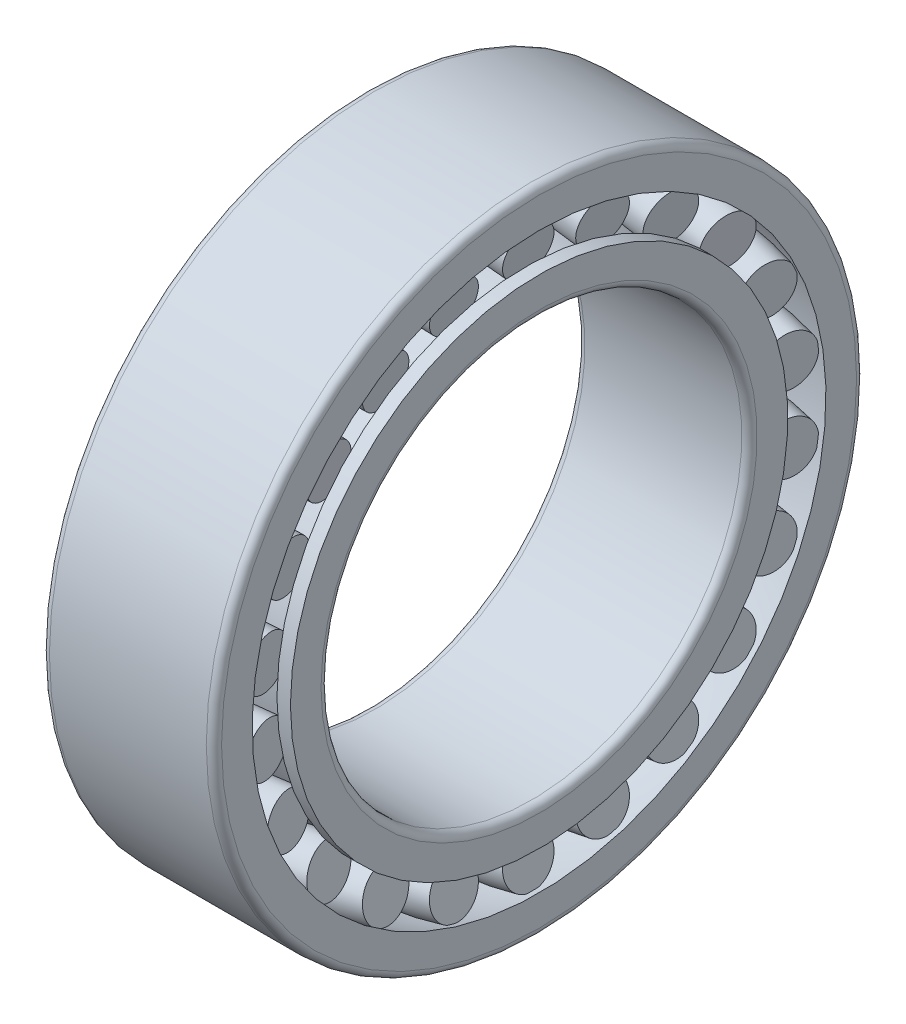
ISO-10303-21;
HEADER;
FILE_DESCRIPTION(('STEP AP214'),'2;1');
FILE_NAME('part.step','',(''),(''),'','','');
FILE_SCHEMA(('AUTOMOTIVE_DESIGN { 1 0 10303 214 1 1 1 1 }'));
ENDSEC;
DATA;
#1=APPLICATION_CONTEXT('core data for automotive mechanical design processes');
#2=APPLICATION_PROTOCOL_DEFINITION('international standard','automotive_design',2000,#1);
#3=PRODUCT_CONTEXT('',#1,'mechanical');
#4=PRODUCT('Part','Part','',(#3));
#5=PRODUCT_RELATED_PRODUCT_CATEGORY('part','',(#4));
#6=PRODUCT_DEFINITION_FORMATION('','',#4);
#7=PRODUCT_DEFINITION_CONTEXT('part definition',#1,'design');
#8=PRODUCT_DEFINITION('design','',#6,#7);
#9=PRODUCT_DEFINITION_SHAPE('','',#8);
#10=(LENGTH_UNIT() NAMED_UNIT(*) SI_UNIT(.MILLI.,.METRE.));
#11=(NAMED_UNIT(*) PLANE_ANGLE_UNIT() SI_UNIT($,.RADIAN.));
#12=(NAMED_UNIT(*) SI_UNIT($,.STERADIAN.) SOLID_ANGLE_UNIT());
#13=UNCERTAINTY_MEASURE_WITH_UNIT(LENGTH_MEASURE(1.E-05),#10,'distance_accuracy_value','');
#14=(GEOMETRIC_REPRESENTATION_CONTEXT(3) GLOBAL_UNCERTAINTY_ASSIGNED_CONTEXT((#13)) GLOBAL_UNIT_ASSIGNED_CONTEXT((#10,
#11,#12)) REPRESENTATION_CONTEXT('',''));
#15=CARTESIAN_POINT('',(0.,0.,0.));
#16=DIRECTION('',(0.,0.,1.));
#17=DIRECTION('',(1.,0.,0.));
#18=AXIS2_PLACEMENT_3D('',#15,#16,#17);
#19=CARTESIAN_POINT('',(-12.2803867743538,67.3977460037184,-19.7897637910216));
#20=DIRECTION('',(-0.985059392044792,-0.165239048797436,0.0485185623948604));
#21=DIRECTION('',(0.172214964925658,-0.94515756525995,0.27752330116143));
#22=AXIS2_PLACEMENT_3D('',#19,#20,#21);
#23=DEGENERATE_TOROIDAL_SURFACE('',#22,71.3084764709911,78.3022988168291,.F.);
#24=CARTESIAN_POINT('',(-19.66833221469,66.1584531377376,-19.4258745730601));
#25=DIRECTION('',(-0.985059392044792,-0.165239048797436,0.0485185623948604));
#26=DIRECTION('',(0.172214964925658,-0.94515756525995,0.27752330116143));
#27=AXIS2_PLACEMENT_3D('',#24,#25,#26);
#28=CIRCLE('',#27,6.63380986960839);
#29=CARTESIAN_POINT('',(-18.5258908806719,59.8884575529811,-17.5848377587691));
#30=VERTEX_POINT('',#29);
#31=EDGE_CURVE('E11',#30,#30,#28,.T.);
#32=ORIENTED_EDGE('',*,*,#31,.F.);
#33=EDGE_LOOP('',(#32));
#34=FACE_BOUND('',#33,.T.);
#35=CARTESIAN_POINT('',(-4.8924413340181,68.6370388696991,-20.153653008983));
#36=DIRECTION('',(-0.985059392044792,-0.165239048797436,0.0485185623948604));
#37=DIRECTION('',(0.172214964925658,-0.94515756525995,0.27752330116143));
#38=AXIS2_PLACEMENT_3D('',#35,#36,#37);
#39=CIRCLE('',#38,6.63380986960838);
#40=CARTESIAN_POINT('',(-3.75000000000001,62.3670432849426,-18.3126161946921));
#41=VERTEX_POINT('',#40);
#42=EDGE_CURVE('E48',#41,#41,#39,.T.);
#43=ORIENTED_EDGE('',*,*,#42,.T.);
#44=EDGE_LOOP('',(#43));
#45=FACE_BOUND('',#44,.T.);
#46=ADVANCED_FACE('F42',(#34,#45),#23,.F.);
#47=CARTESIAN_POINT('',(-20.8107735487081,72.428448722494,-21.2669113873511));
#48=DIRECTION('',(0.985059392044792,0.165239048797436,-0.0485185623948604));
#49=DIRECTION('',(-0.172214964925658,0.94515756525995,-0.27752330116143));
#50=AXIS2_PLACEMENT_3D('',#47,#48,#49);
#51=PLANE('',#50);
#52=ORIENTED_EDGE('',*,*,#31,.T.);
#53=EDGE_LOOP('',(#52));
#54=FACE_BOUND('',#53,.T.);
#55=ADVANCED_FACE('F57',(#54),#51,.F.);
#56=CARTESIAN_POINT('',(-4.8924413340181,68.6370388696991,-20.1536530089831));
#57=DIRECTION('',(-0.985059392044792,-0.165239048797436,0.0485185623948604));
#58=DIRECTION('',(0.172214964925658,-0.94515756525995,0.27752330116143));
#59=AXIS2_PLACEMENT_3D('',#56,#57,#58);
#60=PLANE('',#59);
#61=ORIENTED_EDGE('',*,*,#42,.F.);
#62=EDGE_LOOP('',(#61));
#63=FACE_BOUND('',#62,.T.);
#64=ADVANCED_FACE('F55',(#63),#60,.F.);
#65=CLOSED_SHELL('',(#46,#55,#64));
#66=MANIFOLD_SOLID_BREP('B2',#65);
#67=CARTESIAN_POINT('',(-12.2803867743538,59.0922429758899,-37.9762786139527));
#68=DIRECTION('',(-0.985059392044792,-0.144876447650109,0.0931064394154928));
#69=DIRECTION('',(0.172214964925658,-0.828684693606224,0.532563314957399));
#70=AXIS2_PLACEMENT_3D('',#67,#68,#69);
#71=DEGENERATE_TOROIDAL_SURFACE('',#70,71.3084764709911,78.3022988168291,.F.);
#72=CARTESIAN_POINT('',(-19.66833221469,58.005669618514,-37.2779803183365));
#73=DIRECTION('',(-0.985059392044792,-0.144876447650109,0.0931064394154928));
#74=DIRECTION('',(0.172214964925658,-0.828684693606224,0.532563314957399));
#75=AXIS2_PLACEMENT_3D('',#72,#73,#74);
#76=CIRCLE('',#75,6.63380986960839);
#77=CARTESIAN_POINT('',(-18.5258908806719,52.5083329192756,-33.7450565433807));
#78=VERTEX_POINT('',#77);
#79=EDGE_CURVE('E41',#78,#78,#76,.T.);
#80=ORIENTED_EDGE('',*,*,#79,.F.);
#81=EDGE_LOOP('',(#80));
#82=FACE_BOUND('',#81,.T.);
#83=CARTESIAN_POINT('',(-4.8924413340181,60.1788163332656,-38.6745769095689));
#84=DIRECTION('',(-0.985059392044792,-0.144876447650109,0.0931064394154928));
#85=DIRECTION('',(0.172214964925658,-0.828684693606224,0.532563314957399));
#86=AXIS2_PLACEMENT_3D('',#83,#84,#85);
#87=CIRCLE('',#86,6.63380986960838);
#88=CARTESIAN_POINT('',(-3.75000000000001,54.6814796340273,-35.1416531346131));
#89=VERTEX_POINT('',#88);
#90=EDGE_CURVE('E97',#89,#89,#87,.T.);
#91=ORIENTED_EDGE('',*,*,#90,.T.);
#92=EDGE_LOOP('',(#91));
#93=FACE_BOUND('',#92,.T.);
#94=ADVANCED_FACE('F91',(#82,#93),#71,.F.);
#95=CARTESIAN_POINT('',(-20.8107735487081,63.5030063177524,-40.8109040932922));
#96=DIRECTION('',(0.985059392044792,0.144876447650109,-0.0931064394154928));
#97=DIRECTION('',(-0.172214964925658,0.828684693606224,-0.532563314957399));
#98=AXIS2_PLACEMENT_3D('',#95,#96,#97);
#99=PLANE('',#98);
#100=ORIENTED_EDGE('',*,*,#79,.T.);
#101=EDGE_LOOP('',(#100));
#102=FACE_BOUND('',#101,.T.);
#103=ADVANCED_FACE('F106',(#102),#99,.F.);
#104=CARTESIAN_POINT('',(-4.8924413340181,60.1788163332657,-38.6745769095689));
#105=DIRECTION('',(-0.985059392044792,-0.144876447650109,0.0931064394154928));
#106=DIRECTION('',(0.172214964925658,-0.828684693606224,0.532563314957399));
#107=AXIS2_PLACEMENT_3D('',#104,#105,#106);
#108=PLANE('',#107);
#109=ORIENTED_EDGE('',*,*,#90,.F.);
#110=EDGE_LOOP('',(#109));
#111=FACE_BOUND('',#110,.T.);
#112=ADVANCED_FACE('F104',(#111),#108,.F.);
#113=CLOSED_SHELL('',(#94,#103,#112));
#114=MANIFOLD_SOLID_BREP('B6',#113);
#115=CARTESIAN_POINT('',(-12.2803867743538,45.9994378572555,-53.0861811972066));
#116=DIRECTION('',(-0.985059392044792,-0.112776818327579,0.130151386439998));
#117=DIRECTION('',(0.172214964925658,-0.645076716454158,0.744458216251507));
#118=AXIS2_PLACEMENT_3D('',#115,#116,#117);
#119=DEGENERATE_TOROIDAL_SURFACE('',#118,71.3084764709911,78.3022988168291,.F.);
#120=CARTESIAN_POINT('',(-19.66833221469,45.1536117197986,-52.1100457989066));
#121=DIRECTION('',(-0.985059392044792,-0.112776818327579,0.130151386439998));
#122=DIRECTION('',(0.172214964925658,-0.645076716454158,0.744458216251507));
#123=AXIS2_PLACEMENT_3D('',#120,#121,#122);
#124=CIRCLE('',#123,6.63380986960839);
#125=CARTESIAN_POINT('',(-18.5258908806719,40.8742954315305,-47.1714515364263));
#126=VERTEX_POINT('',#125);
#127=EDGE_CURVE('E90',#126,#126,#124,.T.);
#128=ORIENTED_EDGE('',*,*,#127,.F.);
#129=EDGE_LOOP('',(#128));
#130=FACE_BOUND('',#129,.T.);
#131=CARTESIAN_POINT('',(-4.8924413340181,46.8452639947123,-54.0623165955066));
#132=DIRECTION('',(-0.985059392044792,-0.112776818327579,0.130151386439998));
#133=DIRECTION('',(0.172214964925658,-0.645076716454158,0.744458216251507));
#134=AXIS2_PLACEMENT_3D('',#131,#132,#133);
#135=CIRCLE('',#134,6.63380986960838);
#136=CARTESIAN_POINT('',(-3.75000000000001,42.5659477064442,-49.1237223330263));
#137=VERTEX_POINT('',#136);
#138=EDGE_CURVE('E146',#137,#137,#135,.T.);
#139=ORIENTED_EDGE('',*,*,#138,.T.);
#140=EDGE_LOOP('',(#139));
#141=FACE_BOUND('',#140,.T.);
#142=ADVANCED_FACE('F140',(#130,#141),#119,.F.);
#143=CARTESIAN_POINT('',(-20.8107735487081,49.4329280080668,-57.0486400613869));
#144=DIRECTION('',(0.985059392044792,0.112776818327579,-0.130151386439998));
#145=DIRECTION('',(-0.172214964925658,0.645076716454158,-0.744458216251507));
#146=AXIS2_PLACEMENT_3D('',#143,#144,#145);
#147=PLANE('',#146);
#148=ORIENTED_EDGE('',*,*,#127,.T.);
#149=EDGE_LOOP('',(#148));
#150=FACE_BOUND('',#149,.T.);
#151=ADVANCED_FACE('F155',(#150),#147,.F.);
#152=CARTESIAN_POINT('',(-4.8924413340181,46.8452639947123,-54.0623165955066));
#153=DIRECTION('',(-0.985059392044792,-0.112776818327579,0.130151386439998));
#154=DIRECTION('',(0.172214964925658,-0.645076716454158,0.744458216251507));
#155=AXIS2_PLACEMENT_3D('',#152,#153,#154);
#156=PLANE('',#155);
#157=ORIENTED_EDGE('',*,*,#138,.F.);
#158=EDGE_LOOP('',(#157));
#159=FACE_BOUND('',#158,.T.);
#160=ADVANCED_FACE('F153',(#159),#156,.F.);
#161=CLOSED_SHELL('',(#142,#151,#160));
#162=MANIFOLD_SOLID_BREP('B36',#161);
#163=CARTESIAN_POINT('',(-12.2803867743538,29.1800318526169,-63.8953570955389));
#164=DIRECTION('',(-0.985059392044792,-0.0715406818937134,0.156652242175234));
#165=DIRECTION('',(0.172214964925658,-0.409208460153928,0.896041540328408));
#166=AXIS2_PLACEMENT_3D('',#163,#164,#165);
#167=DEGENERATE_TOROIDAL_SURFACE('',#166,71.3084764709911,78.3022988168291,.F.);
#168=CARTESIAN_POINT('',(-19.66833221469,28.643476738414,-62.7204652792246));
#169=DIRECTION('',(-0.985059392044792,-0.0715406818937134,0.156652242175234));
#170=DIRECTION('',(0.172214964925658,-0.409208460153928,0.896041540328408));
#171=AXIS2_PLACEMENT_3D('',#168,#169,#170);
#172=CIRCLE('',#171,6.63380986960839);
#173=CARTESIAN_POINT('',(-18.5258908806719,25.9288656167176,-56.7762960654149));
#174=VERTEX_POINT('',#173);
#175=EDGE_CURVE('E139',#174,#174,#172,.T.);
#176=ORIENTED_EDGE('',*,*,#175,.F.);
#177=EDGE_LOOP('',(#176));
#178=FACE_BOUND('',#177,.T.);
#179=CARTESIAN_POINT('',(-4.8924413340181,29.7165869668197,-65.0702489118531));
#180=DIRECTION('',(-0.985059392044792,-0.0715406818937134,0.156652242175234));
#181=DIRECTION('',(0.172214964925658,-0.409208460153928,0.896041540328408));
#182=AXIS2_PLACEMENT_3D('',#179,#180,#181);
#183=CIRCLE('',#182,6.63380986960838);
#184=CARTESIAN_POINT('',(-3.75000000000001,27.0019758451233,-59.1260796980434));
#185=VERTEX_POINT('',#184);
#186=EDGE_CURVE('E195',#185,#185,#183,.T.);
#187=ORIENTED_EDGE('',*,*,#186,.T.);
#188=EDGE_LOOP('',(#187));
#189=FACE_BOUND('',#188,.T.);
#190=ADVANCED_FACE('F189',(#178,#189),#167,.F.);
#191=CARTESIAN_POINT('',(-20.8107735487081,31.3580878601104,-68.6646344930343));
#192=DIRECTION('',(0.985059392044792,0.0715406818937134,-0.156652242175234));
#193=DIRECTION('',(-0.172214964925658,0.409208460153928,-0.896041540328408));
#194=AXIS2_PLACEMENT_3D('',#191,#192,#193);
#195=PLANE('',#194);
#196=ORIENTED_EDGE('',*,*,#175,.T.);
#197=EDGE_LOOP('',(#196));
#198=FACE_BOUND('',#197,.T.);
#199=ADVANCED_FACE('F204',(#198),#195,.F.);
#200=CARTESIAN_POINT('',(-4.8924413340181,29.7165869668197,-65.0702489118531));
#201=DIRECTION('',(-0.985059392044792,-0.0715406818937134,0.156652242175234));
#202=DIRECTION('',(0.172214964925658,-0.409208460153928,0.896041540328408));
#203=AXIS2_PLACEMENT_3D('',#200,#201,#202);
#204=PLANE('',#203);
#205=ORIENTED_EDGE('',*,*,#186,.F.);
#206=EDGE_LOOP('',(#205));
#207=FACE_BOUND('',#206,.T.);
#208=ADVANCED_FACE('F202',(#207),#204,.F.);
#209=CLOSED_SHELL('',(#190,#199,#208));
#210=MANIFOLD_SOLID_BREP('B85',#209);
#211=CARTESIAN_POINT('',(-12.2803867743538,9.99663320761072,-69.5281111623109));
#212=DIRECTION('',(-0.985059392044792,-0.0245087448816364,0.170462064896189));
#213=DIRECTION('',(0.172214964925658,-0.140188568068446,0.975032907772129));
#214=AXIS2_PLACEMENT_3D('',#211,#212,#213);
#215=DEGENERATE_TOROIDAL_SURFACE('',#214,71.3084764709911,78.3022988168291,.F.);
#216=CARTESIAN_POINT('',(-19.66833221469,9.81281762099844,-68.2496456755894));
#217=DIRECTION('',(-0.985059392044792,-0.0245087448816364,0.170462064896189));
#218=DIRECTION('',(0.172214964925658,-0.140188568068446,0.975032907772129));
#219=AXIS2_PLACEMENT_3D('',#216,#217,#218);
#220=CIRCLE('',#219,6.63380986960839);
#221=CARTESIAN_POINT('',(-18.5258908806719,8.88283331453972,-61.7814627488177));
#222=VERTEX_POINT('',#221);
#223=EDGE_CURVE('E188',#222,#222,#220,.T.);
#224=ORIENTED_EDGE('',*,*,#223,.F.);
#225=EDGE_LOOP('',(#224));
#226=FACE_BOUND('',#225,.T.);
#227=CARTESIAN_POINT('',(-4.8924413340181,10.180448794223,-70.8065766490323));
#228=DIRECTION('',(-0.985059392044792,-0.0245087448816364,0.170462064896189));
#229=DIRECTION('',(0.172214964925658,-0.140188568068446,0.975032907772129));
#230=AXIS2_PLACEMENT_3D('',#227,#228,#229);
#231=CIRCLE('',#230,6.63380986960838);
#232=CARTESIAN_POINT('',(-3.75000000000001,9.25046448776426,-64.3383937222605));
#233=VERTEX_POINT('',#232);
#234=EDGE_CURVE('E244',#233,#233,#231,.T.);
#235=ORIENTED_EDGE('',*,*,#234,.T.);
#236=EDGE_LOOP('',(#235));
#237=FACE_BOUND('',#236,.T.);
#238=ADVANCED_FACE('F238',(#226,#237),#215,.F.);
#239=CARTESIAN_POINT('',(-20.8107735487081,10.7428019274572,-74.7178286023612));
#240=DIRECTION('',(0.985059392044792,0.0245087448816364,-0.170462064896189));
#241=DIRECTION('',(-0.172214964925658,0.140188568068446,-0.975032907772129));
#242=AXIS2_PLACEMENT_3D('',#239,#240,#241);
#243=PLANE('',#242);
#244=ORIENTED_EDGE('',*,*,#223,.T.);
#245=EDGE_LOOP('',(#244));
#246=FACE_BOUND('',#245,.T.);
#247=ADVANCED_FACE('F253',(#246),#243,.F.);
#248=CARTESIAN_POINT('',(-4.8924413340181,10.180448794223,-70.8065766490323));
#249=DIRECTION('',(-0.985059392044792,-0.0245087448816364,0.170462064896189));
#250=DIRECTION('',(0.172214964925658,-0.140188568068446,0.975032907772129));
#251=AXIS2_PLACEMENT_3D('',#248,#249,#250);
#252=PLANE('',#251);
#253=ORIENTED_EDGE('',*,*,#234,.F.);
#254=EDGE_LOOP('',(#253));
#255=FACE_BOUND('',#254,.T.);
#256=ADVANCED_FACE('F251',(#255),#252,.F.);
#257=CLOSED_SHELL('',(#238,#247,#256));
#258=MANIFOLD_SOLID_BREP('B134',#257);
#259=CARTESIAN_POINT('',(-12.2803867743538,-9.9966332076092,-69.5281111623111));
#260=DIRECTION('',(-0.985059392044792,0.0245087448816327,0.170462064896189));
#261=DIRECTION('',(0.172214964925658,0.140188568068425,0.975032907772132));
#262=AXIS2_PLACEMENT_3D('',#259,#260,#261);
#263=DEGENERATE_TOROIDAL_SURFACE('',#262,71.3084764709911,78.3022988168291,.F.);
#264=CARTESIAN_POINT('',(-19.66833221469,-9.81281762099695,-68.2496456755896));
#265=DIRECTION('',(-0.985059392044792,0.0245087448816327,0.170462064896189));
#266=DIRECTION('',(0.172214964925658,0.140188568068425,0.975032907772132));
#267=AXIS2_PLACEMENT_3D('',#264,#265,#266);
#268=CIRCLE('',#267,6.63380986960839);
#269=CARTESIAN_POINT('',(-18.5258908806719,-8.88283331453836,-61.7814627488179));
#270=VERTEX_POINT('',#269);
#271=EDGE_CURVE('E237',#270,#270,#268,.T.);
#272=ORIENTED_EDGE('',*,*,#271,.F.);
#273=EDGE_LOOP('',(#272));
#274=FACE_BOUND('',#273,.T.);
#275=CARTESIAN_POINT('',(-4.8924413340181,-10.1804487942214,-70.8065766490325));
#276=DIRECTION('',(-0.985059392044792,0.0245087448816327,0.170462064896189));
#277=DIRECTION('',(0.172214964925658,0.140188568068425,0.975032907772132));
#278=AXIS2_PLACEMENT_3D('',#275,#276,#277);
#279=CIRCLE('',#278,6.63380986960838);
#280=CARTESIAN_POINT('',(-3.75000000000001,-9.25046448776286,-64.3383937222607));
#281=VERTEX_POINT('',#280);
#282=EDGE_CURVE('E293',#281,#281,#279,.T.);
#283=ORIENTED_EDGE('',*,*,#282,.T.);
#284=EDGE_LOOP('',(#283));
#285=FACE_BOUND('',#284,.T.);
#286=ADVANCED_FACE('F287',(#274,#285),#263,.F.);
#287=CARTESIAN_POINT('',(-20.8107735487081,-10.7428019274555,-74.7178286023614));
#288=DIRECTION('',(0.985059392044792,-0.0245087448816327,-0.170462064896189));
#289=DIRECTION('',(-0.172214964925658,-0.140188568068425,-0.975032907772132));
#290=AXIS2_PLACEMENT_3D('',#287,#288,#289);
#291=PLANE('',#290);
#292=ORIENTED_EDGE('',*,*,#271,.T.);
#293=EDGE_LOOP('',(#292));
#294=FACE_BOUND('',#293,.T.);
#295=ADVANCED_FACE('F302',(#294),#291,.F.);
#296=CARTESIAN_POINT('',(-4.8924413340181,-10.1804487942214,-70.8065766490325));
#297=DIRECTION('',(-0.985059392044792,0.0245087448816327,0.170462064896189));
#298=DIRECTION('',(0.172214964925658,0.140188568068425,0.975032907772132));
#299=AXIS2_PLACEMENT_3D('',#296,#297,#298);
#300=PLANE('',#299);
#301=ORIENTED_EDGE('',*,*,#282,.F.);
#302=EDGE_LOOP('',(#301));
#303=FACE_BOUND('',#302,.T.);
#304=ADVANCED_FACE('F300',(#303),#300,.F.);
#305=CLOSED_SHELL('',(#286,#295,#304));
#306=MANIFOLD_SOLID_BREP('B183',#305);
#307=CARTESIAN_POINT('',(-12.2803867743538,-29.1800318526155,-63.8953570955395));
#308=DIRECTION('',(-0.985059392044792,0.07154068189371,0.156652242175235));
#309=DIRECTION('',(0.172214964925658,0.409208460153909,0.896041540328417));
#310=AXIS2_PLACEMENT_3D('',#307,#308,#309);
#311=DEGENERATE_TOROIDAL_SURFACE('',#310,71.3084764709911,78.3022988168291,.F.);
#312=CARTESIAN_POINT('',(-19.66833221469,-28.6434767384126,-62.7204652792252));
#313=DIRECTION('',(-0.985059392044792,0.07154068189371,0.156652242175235));
#314=DIRECTION('',(0.172214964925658,0.409208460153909,0.896041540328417));
#315=AXIS2_PLACEMENT_3D('',#312,#313,#314);
#316=CIRCLE('',#315,6.63380986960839);
#317=CARTESIAN_POINT('',(-18.5258908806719,-25.9288656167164,-56.7762960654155));
#318=VERTEX_POINT('',#317);
#319=EDGE_CURVE('E286',#318,#318,#316,.T.);
#320=ORIENTED_EDGE('',*,*,#319,.F.);
#321=EDGE_LOOP('',(#320));
#322=FACE_BOUND('',#321,.T.);
#323=CARTESIAN_POINT('',(-4.8924413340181,-29.7165869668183,-65.0702489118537));
#324=DIRECTION('',(-0.985059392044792,0.07154068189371,0.156652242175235));
#325=DIRECTION('',(0.172214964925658,0.409208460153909,0.896041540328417));
#326=AXIS2_PLACEMENT_3D('',#323,#324,#325);
#327=CIRCLE('',#326,6.63380986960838);
#328=CARTESIAN_POINT('',(-3.75000000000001,-27.001975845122,-59.126079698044));
#329=VERTEX_POINT('',#328);
#330=EDGE_CURVE('E342',#329,#329,#327,.T.);
#331=ORIENTED_EDGE('',*,*,#330,.T.);
#332=EDGE_LOOP('',(#331));
#333=FACE_BOUND('',#332,.T.);
#334=ADVANCED_FACE('F336',(#322,#333),#311,.F.);
#335=CARTESIAN_POINT('',(-20.8107735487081,-31.3580878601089,-68.664634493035));
#336=DIRECTION('',(0.985059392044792,-0.07154068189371,-0.156652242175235));
#337=DIRECTION('',(-0.172214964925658,-0.409208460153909,-0.896041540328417));
#338=AXIS2_PLACEMENT_3D('',#335,#336,#337);
#339=PLANE('',#338);
#340=ORIENTED_EDGE('',*,*,#319,.T.);
#341=EDGE_LOOP('',(#340));
#342=FACE_BOUND('',#341,.T.);
#343=ADVANCED_FACE('F351',(#342),#339,.F.);
#344=CARTESIAN_POINT('',(-4.8924413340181,-29.7165869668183,-65.0702489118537));
#345=DIRECTION('',(-0.985059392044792,0.07154068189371,0.156652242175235));
#346=DIRECTION('',(0.172214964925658,0.409208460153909,0.896041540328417));
#347=AXIS2_PLACEMENT_3D('',#344,#345,#346);
#348=PLANE('',#347);
#349=ORIENTED_EDGE('',*,*,#330,.F.);
#350=EDGE_LOOP('',(#349));
#351=FACE_BOUND('',#350,.T.);
#352=ADVANCED_FACE('F349',(#351),#348,.F.);
#353=CLOSED_SHELL('',(#334,#343,#352));
#354=MANIFOLD_SOLID_BREP('B232',#353);
#355=CARTESIAN_POINT('',(-12.2803867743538,-45.9994378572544,-53.0861811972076));
#356=DIRECTION('',(-0.985059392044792,0.112776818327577,0.13015138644));
#357=DIRECTION('',(0.172214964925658,0.645076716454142,0.744458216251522));
#358=AXIS2_PLACEMENT_3D('',#355,#356,#357);
#359=DEGENERATE_TOROIDAL_SURFACE('',#358,71.3084764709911,78.3022988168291,.F.);
#360=CARTESIAN_POINT('',(-19.66833221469,-45.1536117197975,-52.1100457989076));
#361=DIRECTION('',(-0.985059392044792,0.112776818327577,0.13015138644));
#362=DIRECTION('',(0.172214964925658,0.645076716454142,0.744458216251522));
#363=AXIS2_PLACEMENT_3D('',#360,#361,#362);
#364=CIRCLE('',#363,6.63380986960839);
#365=CARTESIAN_POINT('',(-18.5258908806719,-40.8742954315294,-47.1714515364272));
#366=VERTEX_POINT('',#365);
#367=EDGE_CURVE('E335',#366,#366,#364,.T.);
#368=ORIENTED_EDGE('',*,*,#367,.F.);
#369=EDGE_LOOP('',(#368));
#370=FACE_BOUND('',#369,.T.);
#371=CARTESIAN_POINT('',(-4.8924413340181,-46.8452639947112,-54.0623165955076));
#372=DIRECTION('',(-0.985059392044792,0.112776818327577,0.13015138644));
#373=DIRECTION('',(0.172214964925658,0.645076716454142,0.744458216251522));
#374=AXIS2_PLACEMENT_3D('',#371,#372,#373);
#375=CIRCLE('',#374,6.63380986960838);
#376=CARTESIAN_POINT('',(-3.75000000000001,-42.5659477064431,-49.1237223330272));
#377=VERTEX_POINT('',#376);
#378=EDGE_CURVE('E391',#377,#377,#375,.T.);
#379=ORIENTED_EDGE('',*,*,#378,.T.);
#380=EDGE_LOOP('',(#379));
#381=FACE_BOUND('',#380,.T.);
#382=ADVANCED_FACE('F385',(#370,#381),#359,.F.);
#383=CARTESIAN_POINT('',(-20.8107735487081,-49.4329280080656,-57.048640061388));
#384=DIRECTION('',(0.985059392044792,-0.112776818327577,-0.13015138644));
#385=DIRECTION('',(-0.172214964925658,-0.645076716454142,-0.744458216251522));
#386=AXIS2_PLACEMENT_3D('',#383,#384,#385);
#387=PLANE('',#386);
#388=ORIENTED_EDGE('',*,*,#367,.T.);
#389=EDGE_LOOP('',(#388));
#390=FACE_BOUND('',#389,.T.);
#391=ADVANCED_FACE('F400',(#390),#387,.F.);
#392=CARTESIAN_POINT('',(-4.8924413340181,-46.8452639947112,-54.0623165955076));
#393=DIRECTION('',(-0.985059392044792,0.112776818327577,0.13015138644));
#394=DIRECTION('',(0.172214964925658,0.645076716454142,0.744458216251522));
#395=AXIS2_PLACEMENT_3D('',#392,#393,#394);
#396=PLANE('',#395);
#397=ORIENTED_EDGE('',*,*,#378,.F.);
#398=EDGE_LOOP('',(#397));
#399=FACE_BOUND('',#398,.T.);
#400=ADVANCED_FACE('F398',(#399),#396,.F.);
#401=CLOSED_SHELL('',(#382,#391,#400));
#402=MANIFOLD_SOLID_BREP('B281',#401);
#403=CARTESIAN_POINT('',(-12.2803867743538,-59.092242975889,-37.976278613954));
#404=DIRECTION('',(-0.985059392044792,0.144876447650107,0.0931064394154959));
#405=DIRECTION('',(0.172214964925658,0.828684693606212,0.532563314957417));
#406=AXIS2_PLACEMENT_3D('',#403,#404,#405);
#407=DEGENERATE_TOROIDAL_SURFACE('',#406,71.3084764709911,78.3022988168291,.F.);
#408=CARTESIAN_POINT('',(-19.66833221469,-58.0056696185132,-37.2779803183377));
#409=DIRECTION('',(-0.985059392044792,0.144876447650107,0.0931064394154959));
#410=DIRECTION('',(0.172214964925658,0.828684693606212,0.532563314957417));
#411=AXIS2_PLACEMENT_3D('',#408,#409,#410);
#412=CIRCLE('',#411,6.63380986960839);
#413=CARTESIAN_POINT('',(-18.5258908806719,-52.5083329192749,-33.7450565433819));
#414=VERTEX_POINT('',#413);
#415=EDGE_CURVE('E384',#414,#414,#412,.T.);
#416=ORIENTED_EDGE('',*,*,#415,.F.);
#417=EDGE_LOOP('',(#416));
#418=FACE_BOUND('',#417,.T.);
#419=CARTESIAN_POINT('',(-4.8924413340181,-60.1788163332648,-38.6745769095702));
#420=DIRECTION('',(-0.985059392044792,0.144876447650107,0.0931064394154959));
#421=DIRECTION('',(0.172214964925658,0.828684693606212,0.532563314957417));
#422=AXIS2_PLACEMENT_3D('',#419,#420,#421);
#423=CIRCLE('',#422,6.63380986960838);
#424=CARTESIAN_POINT('',(-3.75000000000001,-54.6814796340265,-35.1416531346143));
#425=VERTEX_POINT('',#424);
#426=EDGE_CURVE('E440',#425,#425,#423,.T.);
#427=ORIENTED_EDGE('',*,*,#426,.T.);
#428=EDGE_LOOP('',(#427));
#429=FACE_BOUND('',#428,.T.);
#430=ADVANCED_FACE('F434',(#418,#429),#407,.F.);
#431=CARTESIAN_POINT('',(-20.8107735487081,-63.5030063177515,-40.8109040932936));
#432=DIRECTION('',(0.985059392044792,-0.144876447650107,-0.0931064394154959));
#433=DIRECTION('',(-0.172214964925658,-0.828684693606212,-0.532563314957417));
#434=AXIS2_PLACEMENT_3D('',#431,#432,#433);
#435=PLANE('',#434);
#436=ORIENTED_EDGE('',*,*,#415,.T.);
#437=EDGE_LOOP('',(#436));
#438=FACE_BOUND('',#437,.T.);
#439=ADVANCED_FACE('F449',(#438),#435,.F.);
#440=CARTESIAN_POINT('',(-4.8924413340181,-60.1788163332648,-38.6745769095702));
#441=DIRECTION('',(-0.985059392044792,0.144876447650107,0.0931064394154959));
#442=DIRECTION('',(0.172214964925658,0.828684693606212,0.532563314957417));
#443=AXIS2_PLACEMENT_3D('',#440,#441,#442);
#444=PLANE('',#443);
#445=ORIENTED_EDGE('',*,*,#426,.F.);
#446=EDGE_LOOP('',(#445));
#447=FACE_BOUND('',#446,.T.);
#448=ADVANCED_FACE('F447',(#447),#444,.F.);
#449=CLOSED_SHELL('',(#430,#439,#448));
#450=MANIFOLD_SOLID_BREP('B330',#449);
#451=CARTESIAN_POINT('',(-12.2803867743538,-67.3977460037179,-19.7897637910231));
#452=DIRECTION('',(-0.985059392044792,0.165239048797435,0.048518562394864));
#453=DIRECTION('',(0.172214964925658,0.945157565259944,0.277523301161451));
#454=AXIS2_PLACEMENT_3D('',#451,#452,#453);
#455=DEGENERATE_TOROIDAL_SURFACE('',#454,71.3084764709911,78.3022988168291,.F.);
#456=CARTESIAN_POINT('',(-19.66833221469,-66.1584531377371,-19.4258745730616));
#457=DIRECTION('',(-0.985059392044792,0.165239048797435,0.048518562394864));
#458=DIRECTION('',(0.172214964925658,0.945157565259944,0.277523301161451));
#459=AXIS2_PLACEMENT_3D('',#456,#457,#458);
#460=CIRCLE('',#459,6.63380986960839);
#461=CARTESIAN_POINT('',(-18.5258908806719,-59.8884575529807,-17.5848377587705));
#462=VERTEX_POINT('',#461);
#463=EDGE_CURVE('E433',#462,#462,#460,.T.);
#464=ORIENTED_EDGE('',*,*,#463,.F.);
#465=EDGE_LOOP('',(#464));
#466=FACE_BOUND('',#465,.T.);
#467=CARTESIAN_POINT('',(-4.8924413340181,-68.6370388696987,-20.1536530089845));
#468=DIRECTION('',(-0.985059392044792,0.165239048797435,0.048518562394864));
#469=DIRECTION('',(0.172214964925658,0.945157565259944,0.277523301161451));
#470=AXIS2_PLACEMENT_3D('',#467,#468,#469);
#471=CIRCLE('',#470,6.63380986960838);
#472=CARTESIAN_POINT('',(-3.75000000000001,-62.3670432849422,-18.3126161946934));
#473=VERTEX_POINT('',#472);
#474=EDGE_CURVE('E489',#473,#473,#471,.T.);
#475=ORIENTED_EDGE('',*,*,#474,.T.);
#476=EDGE_LOOP('',(#475));
#477=FACE_BOUND('',#476,.T.);
#478=ADVANCED_FACE('F483',(#466,#477),#455,.F.);
#479=CARTESIAN_POINT('',(-20.8107735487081,-72.4284487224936,-21.2669113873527));
#480=DIRECTION('',(0.985059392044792,-0.165239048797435,-0.048518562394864));
#481=DIRECTION('',(-0.172214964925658,-0.945157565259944,-0.277523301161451));
#482=AXIS2_PLACEMENT_3D('',#479,#480,#481);
#483=PLANE('',#482);
#484=ORIENTED_EDGE('',*,*,#463,.T.);
#485=EDGE_LOOP('',(#484));
#486=FACE_BOUND('',#485,.T.);
#487=ADVANCED_FACE('F498',(#486),#483,.F.);
#488=CARTESIAN_POINT('',(-4.8924413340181,-68.6370388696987,-20.1536530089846));
#489=DIRECTION('',(-0.985059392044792,0.165239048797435,0.048518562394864));
#490=DIRECTION('',(0.172214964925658,0.945157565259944,0.277523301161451));
#491=AXIS2_PLACEMENT_3D('',#488,#489,#490);
#492=PLANE('',#491);
#493=ORIENTED_EDGE('',*,*,#474,.F.);
#494=EDGE_LOOP('',(#493));
#495=FACE_BOUND('',#494,.T.);
#496=ADVANCED_FACE('F496',(#495),#492,.F.);
#497=CLOSED_SHELL('',(#478,#487,#496));
#498=MANIFOLD_SOLID_BREP('B379',#497);
#499=CARTESIAN_POINT('',(-12.2803867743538,-70.2430844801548,-5.21699033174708E-13));
#500=DIRECTION('',(-0.985059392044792,0.172214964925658,0.));
#501=DIRECTION('',(0.172214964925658,0.985059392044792,0.));
#502=AXIS2_PLACEMENT_3D('',#499,#500,#501);
#503=DEGENERATE_TOROIDAL_SURFACE('',#502,71.3084764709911,78.3022988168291,.F.);
#504=CARTESIAN_POINT('',(-19.66833221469,-68.9514722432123,-5.12106162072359E-13));
#505=DIRECTION('',(-0.985059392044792,0.172214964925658,0.));
#506=DIRECTION('',(0.172214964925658,0.985059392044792,0.));
#507=AXIS2_PLACEMENT_3D('',#504,#505,#506);
#508=CIRCLE('',#507,6.63380986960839);
#509=CARTESIAN_POINT('',(-18.5258908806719,-62.4167755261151,-4.63572630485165E-13));
#510=VERTEX_POINT('',#509);
#511=EDGE_CURVE('E482',#510,#510,#508,.T.);
#512=ORIENTED_EDGE('',*,*,#511,.F.);
#513=EDGE_LOOP('',(#512));
#514=FACE_BOUND('',#513,.T.);
#515=CARTESIAN_POINT('',(-4.8924413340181,-71.5346967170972,-5.31291904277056E-13));
#516=DIRECTION('',(-0.985059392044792,0.172214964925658,0.));
#517=DIRECTION('',(0.172214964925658,0.985059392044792,0.));
#518=AXIS2_PLACEMENT_3D('',#515,#516,#517);
#519=CIRCLE('',#518,6.63380986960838);
#520=CARTESIAN_POINT('',(-3.75000000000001,-65.,-4.82758372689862E-13));
#521=VERTEX_POINT('',#520);
#522=EDGE_CURVE('E538',#521,#521,#519,.T.);
#523=ORIENTED_EDGE('',*,*,#522,.T.);
#524=EDGE_LOOP('',(#523));
#525=FACE_BOUND('',#524,.T.);
#526=ADVANCED_FACE('F532',(#514,#525),#503,.F.);
#527=CARTESIAN_POINT('',(-20.8107735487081,-75.4861689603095,-5.60639693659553E-13));
#528=DIRECTION('',(0.985059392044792,-0.172214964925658,0.));
#529=DIRECTION('',(-0.172214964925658,-0.985059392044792,0.));
#530=AXIS2_PLACEMENT_3D('',#527,#528,#529);
#531=PLANE('',#530);
#532=ORIENTED_EDGE('',*,*,#511,.T.);
#533=EDGE_LOOP('',(#532));
#534=FACE_BOUND('',#533,.T.);
#535=ADVANCED_FACE('F547',(#534),#531,.F.);
#536=CARTESIAN_POINT('',(-4.8924413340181,-71.5346967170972,-5.31291904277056E-13));
#537=DIRECTION('',(-0.985059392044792,0.172214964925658,0.));
#538=DIRECTION('',(0.172214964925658,0.985059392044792,0.));
#539=AXIS2_PLACEMENT_3D('',#536,#537,#538);
#540=PLANE('',#539);
#541=ORIENTED_EDGE('',*,*,#522,.F.);
#542=EDGE_LOOP('',(#541));
#543=FACE_BOUND('',#542,.T.);
#544=ADVANCED_FACE('F545',(#543),#540,.F.);
#545=CLOSED_SHELL('',(#526,#535,#544));
#546=MANIFOLD_SOLID_BREP('B428',#545);
#547=CARTESIAN_POINT('',(-12.2803867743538,-67.3977460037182,19.7897637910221));
#548=DIRECTION('',(-0.985059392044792,0.165239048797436,-0.0485185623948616));
#549=DIRECTION('',(0.172214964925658,0.945157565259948,-0.277523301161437));
#550=AXIS2_PLACEMENT_3D('',#547,#548,#549);
#551=DEGENERATE_TOROIDAL_SURFACE('',#550,71.3084764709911,78.3022988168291,.F.);
#552=CARTESIAN_POINT('',(-19.66833221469,-66.1584531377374,19.4258745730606));
#553=DIRECTION('',(-0.985059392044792,0.165239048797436,-0.0485185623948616));
#554=DIRECTION('',(0.172214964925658,0.945157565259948,-0.277523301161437));
#555=AXIS2_PLACEMENT_3D('',#552,#553,#554);
#556=CIRCLE('',#555,6.63380986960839);
#557=CARTESIAN_POINT('',(-18.5258908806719,-59.8884575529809,17.5848377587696));
#558=VERTEX_POINT('',#557);
#559=EDGE_CURVE('E531',#558,#558,#556,.T.);
#560=ORIENTED_EDGE('',*,*,#559,.F.);
#561=EDGE_LOOP('',(#560));
#562=FACE_BOUND('',#561,.T.);
#563=CARTESIAN_POINT('',(-4.8924413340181,-68.637038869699,20.1536530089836));
#564=DIRECTION('',(-0.985059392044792,0.165239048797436,-0.0485185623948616));
#565=DIRECTION('',(0.172214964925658,0.945157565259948,-0.277523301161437));
#566=AXIS2_PLACEMENT_3D('',#563,#564,#565);
#567=CIRCLE('',#566,6.63380986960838);
#568=CARTESIAN_POINT('',(-3.75000000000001,-62.3670432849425,18.3126161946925));
#569=VERTEX_POINT('',#568);
#570=EDGE_CURVE('E587',#569,#569,#567,.T.);
#571=ORIENTED_EDGE('',*,*,#570,.T.);
#572=EDGE_LOOP('',(#571));
#573=FACE_BOUND('',#572,.T.);
#574=ADVANCED_FACE('F581',(#562,#573),#551,.F.);
#575=CARTESIAN_POINT('',(-20.8107735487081,-72.4284487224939,21.2669113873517));
#576=DIRECTION('',(0.985059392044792,-0.165239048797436,0.0485185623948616));
#577=DIRECTION('',(-0.172214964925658,-0.945157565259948,0.277523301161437));
#578=AXIS2_PLACEMENT_3D('',#575,#576,#577);
#579=PLANE('',#578);
#580=ORIENTED_EDGE('',*,*,#559,.T.);
#581=EDGE_LOOP('',(#580));
#582=FACE_BOUND('',#581,.T.);
#583=ADVANCED_FACE('F596',(#582),#579,.F.);
#584=CARTESIAN_POINT('',(-4.8924413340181,-68.637038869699,20.1536530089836));
#585=DIRECTION('',(-0.985059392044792,0.165239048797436,-0.0485185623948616));
#586=DIRECTION('',(0.172214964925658,0.945157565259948,-0.277523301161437));
#587=AXIS2_PLACEMENT_3D('',#584,#585,#586);
#588=PLANE('',#587);
#589=ORIENTED_EDGE('',*,*,#570,.F.);
#590=EDGE_LOOP('',(#589));
#591=FACE_BOUND('',#590,.T.);
#592=ADVANCED_FACE('F594',(#591),#588,.F.);
#593=CLOSED_SHELL('',(#574,#583,#592));
#594=MANIFOLD_SOLID_BREP('B477',#593);
#595=CARTESIAN_POINT('',(-12.2803867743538,-59.0922429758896,37.9762786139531));
#596=DIRECTION('',(-0.985059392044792,0.144876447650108,-0.0931064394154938));
#597=DIRECTION('',(0.172214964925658,0.82868469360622,-0.532563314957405));
#598=AXIS2_PLACEMENT_3D('',#595,#596,#597);
#599=DEGENERATE_TOROIDAL_SURFACE('',#598,71.3084764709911,78.3022988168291,.F.);
#600=CARTESIAN_POINT('',(-19.66833221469,-58.0056696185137,37.2779803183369));
#601=DIRECTION('',(-0.985059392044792,0.144876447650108,-0.0931064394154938));
#602=DIRECTION('',(0.172214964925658,0.82868469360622,-0.532563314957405));
#603=AXIS2_PLACEMENT_3D('',#600,#601,#602);
#604=CIRCLE('',#603,6.63380986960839);
#605=CARTESIAN_POINT('',(-18.5258908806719,-52.5083329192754,33.7450565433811));
#606=VERTEX_POINT('',#605);
#607=EDGE_CURVE('E580',#606,#606,#604,.T.);
#608=ORIENTED_EDGE('',*,*,#607,.F.);
#609=EDGE_LOOP('',(#608));
#610=FACE_BOUND('',#609,.T.);
#611=CARTESIAN_POINT('',(-4.8924413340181,-60.1788163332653,38.6745769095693));
#612=DIRECTION('',(-0.985059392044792,0.144876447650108,-0.0931064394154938));
#613=DIRECTION('',(0.172214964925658,0.82868469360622,-0.532563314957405));
#614=AXIS2_PLACEMENT_3D('',#611,#612,#613);
#615=CIRCLE('',#614,6.63380986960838);
#616=CARTESIAN_POINT('',(-3.75000000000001,-54.681479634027,35.1416531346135));
#617=VERTEX_POINT('',#616);
#618=EDGE_CURVE('E636',#617,#617,#615,.T.);
#619=ORIENTED_EDGE('',*,*,#618,.T.);
#620=EDGE_LOOP('',(#619));
#621=FACE_BOUND('',#620,.T.);
#622=ADVANCED_FACE('F630',(#610,#621),#599,.F.);
#623=CARTESIAN_POINT('',(-20.8107735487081,-63.5030063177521,40.8109040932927));
#624=DIRECTION('',(0.985059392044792,-0.144876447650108,0.0931064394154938));
#625=DIRECTION('',(-0.172214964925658,-0.82868469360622,0.532563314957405));
#626=AXIS2_PLACEMENT_3D('',#623,#624,#625);
#627=PLANE('',#626);
#628=ORIENTED_EDGE('',*,*,#607,.T.);
#629=EDGE_LOOP('',(#628));
#630=FACE_BOUND('',#629,.T.);
#631=ADVANCED_FACE('F645',(#630),#627,.F.);
#632=CARTESIAN_POINT('',(-4.8924413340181,-60.1788163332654,38.6745769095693));
#633=DIRECTION('',(-0.985059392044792,0.144876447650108,-0.0931064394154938));
#634=DIRECTION('',(0.172214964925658,0.82868469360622,-0.532563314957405));
#635=AXIS2_PLACEMENT_3D('',#632,#633,#634);
#636=PLANE('',#635);
#637=ORIENTED_EDGE('',*,*,#618,.F.);
#638=EDGE_LOOP('',(#637));
#639=FACE_BOUND('',#638,.T.);
#640=ADVANCED_FACE('F643',(#639),#636,.F.);
#641=CLOSED_SHELL('',(#622,#631,#640));
#642=MANIFOLD_SOLID_BREP('B526',#641);
#643=CARTESIAN_POINT('',(-12.2803867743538,-45.9994378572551,53.086181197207));
#644=DIRECTION('',(-0.985059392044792,0.112776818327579,-0.130151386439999));
#645=DIRECTION('',(0.172214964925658,0.645076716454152,-0.744458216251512));
#646=AXIS2_PLACEMENT_3D('',#643,#644,#645);
#647=DEGENERATE_TOROIDAL_SURFACE('',#646,71.3084764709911,78.3022988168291,.F.);
#648=CARTESIAN_POINT('',(-19.66833221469,-45.1536117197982,52.1100457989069));
#649=DIRECTION('',(-0.985059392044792,0.112776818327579,-0.130151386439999));
#650=DIRECTION('',(0.172214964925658,0.645076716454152,-0.744458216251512));
#651=AXIS2_PLACEMENT_3D('',#648,#649,#650);
#652=CIRCLE('',#651,6.63380986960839);
#653=CARTESIAN_POINT('',(-18.5258908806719,-40.8742954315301,47.1714515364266));
#654=VERTEX_POINT('',#653);
#655=EDGE_CURVE('E629',#654,#654,#652,.T.);
#656=ORIENTED_EDGE('',*,*,#655,.F.);
#657=EDGE_LOOP('',(#656));
#658=FACE_BOUND('',#657,.T.);
#659=CARTESIAN_POINT('',(-4.8924413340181,-46.8452639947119,54.0623165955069));
#660=DIRECTION('',(-0.985059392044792,0.112776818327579,-0.130151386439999));
#661=DIRECTION('',(0.172214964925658,0.645076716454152,-0.744458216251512));
#662=AXIS2_PLACEMENT_3D('',#659,#660,#661);
#663=CIRCLE('',#662,6.63380986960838);
#664=CARTESIAN_POINT('',(-3.75000000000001,-42.5659477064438,49.1237223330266));
#665=VERTEX_POINT('',#664);
#666=EDGE_CURVE('E685',#665,#665,#663,.T.);
#667=ORIENTED_EDGE('',*,*,#666,.T.);
#668=EDGE_LOOP('',(#667));
#669=FACE_BOUND('',#668,.T.);
#670=ADVANCED_FACE('F679',(#658,#669),#647,.F.);
#671=CARTESIAN_POINT('',(-20.8107735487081,-49.4329280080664,57.0486400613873));
#672=DIRECTION('',(0.985059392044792,-0.112776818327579,0.130151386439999));
#673=DIRECTION('',(-0.172214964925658,-0.645076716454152,0.744458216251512));
#674=AXIS2_PLACEMENT_3D('',#671,#672,#673);
#675=PLANE('',#674);
#676=ORIENTED_EDGE('',*,*,#655,.T.);
#677=EDGE_LOOP('',(#676));
#678=FACE_BOUND('',#677,.T.);
#679=ADVANCED_FACE('F694',(#678),#675,.F.);
#680=CARTESIAN_POINT('',(-4.8924413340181,-46.8452639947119,54.0623165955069));
#681=DIRECTION('',(-0.985059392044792,0.112776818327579,-0.130151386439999));
#682=DIRECTION('',(0.172214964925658,0.645076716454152,-0.744458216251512));
#683=AXIS2_PLACEMENT_3D('',#680,#681,#682);
#684=PLANE('',#683);
#685=ORIENTED_EDGE('',*,*,#666,.F.);
#686=EDGE_LOOP('',(#685));
#687=FACE_BOUND('',#686,.T.);
#688=ADVANCED_FACE('F692',(#687),#684,.F.);
#689=CLOSED_SHELL('',(#670,#679,#688));
#690=MANIFOLD_SOLID_BREP('B575',#689);
#691=CARTESIAN_POINT('',(-12.2803867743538,-29.1800318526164,63.8953570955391));
#692=DIRECTION('',(-0.985059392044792,0.0715406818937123,-0.156652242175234));
#693=DIRECTION('',(0.172214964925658,0.409208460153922,-0.896041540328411));
#694=AXIS2_PLACEMENT_3D('',#691,#692,#693);
#695=DEGENERATE_TOROIDAL_SURFACE('',#694,71.3084764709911,78.3022988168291,.F.);
#696=CARTESIAN_POINT('',(-19.66833221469,-28.6434767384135,62.7204652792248));
#697=DIRECTION('',(-0.985059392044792,0.0715406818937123,-0.156652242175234));
#698=DIRECTION('',(0.172214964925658,0.409208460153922,-0.896041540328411));
#699=AXIS2_PLACEMENT_3D('',#696,#697,#698);
#700=CIRCLE('',#699,6.63380986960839);
#701=CARTESIAN_POINT('',(-18.5258908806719,-25.9288656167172,56.7762960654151));
#702=VERTEX_POINT('',#701);
#703=EDGE_CURVE('E678',#702,#702,#700,.T.);
#704=ORIENTED_EDGE('',*,*,#703,.F.);
#705=EDGE_LOOP('',(#704));
#706=FACE_BOUND('',#705,.T.);
#707=CARTESIAN_POINT('',(-4.8924413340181,-29.7165869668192,65.0702489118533));
#708=DIRECTION('',(-0.985059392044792,0.0715406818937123,-0.156652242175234));
#709=DIRECTION('',(0.172214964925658,0.409208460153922,-0.896041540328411));
#710=AXIS2_PLACEMENT_3D('',#707,#708,#709);
#711=CIRCLE('',#710,6.63380986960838);
#712=CARTESIAN_POINT('',(-3.75000000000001,-27.0019758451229,59.1260796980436));
#713=VERTEX_POINT('',#712);
#714=EDGE_CURVE('E734',#713,#713,#711,.T.);
#715=ORIENTED_EDGE('',*,*,#714,.T.);
#716=EDGE_LOOP('',(#715));
#717=FACE_BOUND('',#716,.T.);
#718=ADVANCED_FACE('F728',(#706,#717),#695,.F.);
#719=CARTESIAN_POINT('',(-20.8107735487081,-31.3580878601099,68.6646344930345));
#720=DIRECTION('',(0.985059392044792,-0.0715406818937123,0.156652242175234));
#721=DIRECTION('',(-0.172214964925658,-0.409208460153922,0.896041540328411));
#722=AXIS2_PLACEMENT_3D('',#719,#720,#721);
#723=PLANE('',#722);
#724=ORIENTED_EDGE('',*,*,#703,.T.);
#725=EDGE_LOOP('',(#724));
#726=FACE_BOUND('',#725,.T.);
#727=ADVANCED_FACE('F743',(#726),#723,.F.);
#728=CARTESIAN_POINT('',(-4.8924413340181,-29.7165869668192,65.0702489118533));
#729=DIRECTION('',(-0.985059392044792,0.0715406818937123,-0.156652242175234));
#730=DIRECTION('',(0.172214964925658,0.409208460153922,-0.896041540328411));
#731=AXIS2_PLACEMENT_3D('',#728,#729,#730);
#732=PLANE('',#731);
#733=ORIENTED_EDGE('',*,*,#714,.F.);
#734=EDGE_LOOP('',(#733));
#735=FACE_BOUND('',#734,.T.);
#736=ADVANCED_FACE('F741',(#735),#732,.F.);
#737=CLOSED_SHELL('',(#718,#727,#736));
#738=MANIFOLD_SOLID_BREP('B624',#737);
#739=CARTESIAN_POINT('',(-12.2803867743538,-9.9966332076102,69.528111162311));
#740=DIRECTION('',(-0.985059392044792,0.0245087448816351,-0.170462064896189));
#741=DIRECTION('',(0.172214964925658,0.140188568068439,-0.97503290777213));
#742=AXIS2_PLACEMENT_3D('',#739,#740,#741);
#743=DEGENERATE_TOROIDAL_SURFACE('',#742,71.3084764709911,78.3022988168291,.F.);
#744=CARTESIAN_POINT('',(-19.66833221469,-9.81281762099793,68.2496456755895));
#745=DIRECTION('',(-0.985059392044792,0.0245087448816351,-0.170462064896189));
#746=DIRECTION('',(0.172214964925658,0.140188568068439,-0.97503290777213));
#747=AXIS2_PLACEMENT_3D('',#744,#745,#746);
#748=CIRCLE('',#747,6.63380986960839);
#749=CARTESIAN_POINT('',(-18.5258908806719,-8.88283331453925,61.7814627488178));
#750=VERTEX_POINT('',#749);
#751=EDGE_CURVE('E727',#750,#750,#748,.T.);
#752=ORIENTED_EDGE('',*,*,#751,.F.);
#753=EDGE_LOOP('',(#752));
#754=FACE_BOUND('',#753,.T.);
#755=CARTESIAN_POINT('',(-4.8924413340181,-10.1804487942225,70.8065766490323));
#756=DIRECTION('',(-0.985059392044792,0.0245087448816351,-0.170462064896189));
#757=DIRECTION('',(0.172214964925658,0.140188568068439,-0.97503290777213));
#758=AXIS2_PLACEMENT_3D('',#755,#756,#757);
#759=CIRCLE('',#758,6.63380986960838);
#760=CARTESIAN_POINT('',(-3.75000000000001,-9.25046448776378,64.3383937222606));
#761=VERTEX_POINT('',#760);
#762=EDGE_CURVE('E783',#761,#761,#759,.T.);
#763=ORIENTED_EDGE('',*,*,#762,.T.);
#764=EDGE_LOOP('',(#763));
#765=FACE_BOUND('',#764,.T.);
#766=ADVANCED_FACE('F777',(#754,#765),#743,.F.);
#767=CARTESIAN_POINT('',(-20.8107735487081,-10.7428019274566,74.7178286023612));
#768=DIRECTION('',(0.985059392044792,-0.0245087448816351,0.170462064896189));
#769=DIRECTION('',(-0.172214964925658,-0.140188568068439,0.97503290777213));
#770=AXIS2_PLACEMENT_3D('',#767,#768,#769);
#771=PLANE('',#770);
#772=ORIENTED_EDGE('',*,*,#751,.T.);
#773=EDGE_LOOP('',(#772));
#774=FACE_BOUND('',#773,.T.);
#775=ADVANCED_FACE('F792',(#774),#771,.F.);
#776=CARTESIAN_POINT('',(-4.8924413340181,-10.1804487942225,70.8065766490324));
#777=DIRECTION('',(-0.985059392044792,0.0245087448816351,-0.170462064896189));
#778=DIRECTION('',(0.172214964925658,0.140188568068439,-0.97503290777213));
#779=AXIS2_PLACEMENT_3D('',#776,#777,#778);
#780=PLANE('',#779);
#781=ORIENTED_EDGE('',*,*,#762,.F.);
#782=EDGE_LOOP('',(#781));
#783=FACE_BOUND('',#782,.T.);
#784=ADVANCED_FACE('F790',(#783),#780,.F.);
#785=CLOSED_SHELL('',(#766,#775,#784));
#786=MANIFOLD_SOLID_BREP('B673',#785);
#787=CARTESIAN_POINT('',(-12.2803867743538,9.9966332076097,69.528111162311));
#788=DIRECTION('',(-0.985059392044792,-0.0245087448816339,-0.170462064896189));
#789=DIRECTION('',(0.172214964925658,-0.140188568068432,-0.975032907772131));
#790=AXIS2_PLACEMENT_3D('',#787,#788,#789);
#791=DEGENERATE_TOROIDAL_SURFACE('',#790,71.3084764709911,78.3022988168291,.F.);
#792=CARTESIAN_POINT('',(-19.66833221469,9.81281762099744,68.2496456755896));
#793=DIRECTION('',(-0.985059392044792,-0.0245087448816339,-0.170462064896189));
#794=DIRECTION('',(0.172214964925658,-0.140188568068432,-0.975032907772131));
#795=AXIS2_PLACEMENT_3D('',#792,#793,#794);
#796=CIRCLE('',#795,6.63380986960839);
#797=CARTESIAN_POINT('',(-18.5258908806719,8.88283331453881,61.7814627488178));
#798=VERTEX_POINT('',#797);
#799=EDGE_CURVE('E776',#798,#798,#796,.T.);
#800=ORIENTED_EDGE('',*,*,#799,.F.);
#801=EDGE_LOOP('',(#800));
#802=FACE_BOUND('',#801,.T.);
#803=CARTESIAN_POINT('',(-4.8924413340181,10.180448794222,70.8065766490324));
#804=DIRECTION('',(-0.985059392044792,-0.0245087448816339,-0.170462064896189));
#805=DIRECTION('',(0.172214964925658,-0.140188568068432,-0.975032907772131));
#806=AXIS2_PLACEMENT_3D('',#803,#804,#805);
#807=CIRCLE('',#806,6.63380986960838);
#808=CARTESIAN_POINT('',(-3.75000000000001,9.25046448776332,64.3383937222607));
#809=VERTEX_POINT('',#808);
#810=EDGE_CURVE('E832',#809,#809,#807,.T.);
#811=ORIENTED_EDGE('',*,*,#810,.T.);
#812=EDGE_LOOP('',(#811));
#813=FACE_BOUND('',#812,.T.);
#814=ADVANCED_FACE('F826',(#802,#813),#791,.F.);
#815=CARTESIAN_POINT('',(-20.8107735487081,10.7428019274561,74.7178286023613));
#816=DIRECTION('',(0.985059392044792,0.0245087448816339,0.170462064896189));
#817=DIRECTION('',(-0.172214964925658,0.140188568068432,0.975032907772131));
#818=AXIS2_PLACEMENT_3D('',#815,#816,#817);
#819=PLANE('',#818);
#820=ORIENTED_EDGE('',*,*,#799,.T.);
#821=EDGE_LOOP('',(#820));
#822=FACE_BOUND('',#821,.T.);
#823=ADVANCED_FACE('F841',(#822),#819,.F.);
#824=CARTESIAN_POINT('',(-4.8924413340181,10.180448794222,70.8065766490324));
#825=DIRECTION('',(-0.985059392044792,-0.0245087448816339,-0.170462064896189));
#826=DIRECTION('',(0.172214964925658,-0.140188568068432,-0.975032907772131));
#827=AXIS2_PLACEMENT_3D('',#824,#825,#826);
#828=PLANE('',#827);
#829=ORIENTED_EDGE('',*,*,#810,.F.);
#830=EDGE_LOOP('',(#829));
#831=FACE_BOUND('',#830,.T.);
#832=ADVANCED_FACE('F839',(#831),#828,.F.);
#833=CLOSED_SHELL('',(#814,#823,#832));
#834=MANIFOLD_SOLID_BREP('B722',#833);
#835=CARTESIAN_POINT('',(-12.2803867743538,29.1800318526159,63.8953570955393));
#836=DIRECTION('',(-0.985059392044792,-0.0715406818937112,-0.156652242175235));
#837=DIRECTION('',(0.172214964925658,-0.409208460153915,-0.896041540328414));
#838=AXIS2_PLACEMENT_3D('',#835,#836,#837);
#839=DEGENERATE_TOROIDAL_SURFACE('',#838,71.3084764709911,78.3022988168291,.F.);
#840=CARTESIAN_POINT('',(-19.66833221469,28.6434767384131,62.720465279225));
#841=DIRECTION('',(-0.985059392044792,-0.0715406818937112,-0.156652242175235));
#842=DIRECTION('',(0.172214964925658,-0.409208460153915,-0.896041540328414));
#843=AXIS2_PLACEMENT_3D('',#840,#841,#842);
#844=CIRCLE('',#843,6.63380986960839);
#845=CARTESIAN_POINT('',(-18.5258908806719,25.9288656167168,56.7762960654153));
#846=VERTEX_POINT('',#845);
#847=EDGE_CURVE('E825',#846,#846,#844,.T.);
#848=ORIENTED_EDGE('',*,*,#847,.F.);
#849=EDGE_LOOP('',(#848));
#850=FACE_BOUND('',#849,.T.);
#851=CARTESIAN_POINT('',(-4.8924413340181,29.7165869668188,65.0702489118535));
#852=DIRECTION('',(-0.985059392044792,-0.0715406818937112,-0.156652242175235));
#853=DIRECTION('',(0.172214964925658,-0.409208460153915,-0.896041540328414));
#854=AXIS2_PLACEMENT_3D('',#851,#852,#853);
#855=CIRCLE('',#854,6.63380986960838);
#856=CARTESIAN_POINT('',(-3.75000000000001,27.0019758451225,59.1260796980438));
#857=VERTEX_POINT('',#856);
#858=EDGE_CURVE('E881',#857,#857,#855,.T.);
#859=ORIENTED_EDGE('',*,*,#858,.T.);
#860=EDGE_LOOP('',(#859));
#861=FACE_BOUND('',#860,.T.);
#862=ADVANCED_FACE('F875',(#850,#861),#839,.F.);
#863=CARTESIAN_POINT('',(-20.8107735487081,31.3580878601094,68.6646344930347));
#864=DIRECTION('',(0.985059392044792,0.0715406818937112,0.156652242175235));
#865=DIRECTION('',(-0.172214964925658,0.409208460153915,0.896041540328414));
#866=AXIS2_PLACEMENT_3D('',#863,#864,#865);
#867=PLANE('',#866);
#868=ORIENTED_EDGE('',*,*,#847,.T.);
#869=EDGE_LOOP('',(#868));
#870=FACE_BOUND('',#869,.T.);
#871=ADVANCED_FACE('F890',(#870),#867,.F.);
#872=CARTESIAN_POINT('',(-4.8924413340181,29.7165869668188,65.0702489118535));
#873=DIRECTION('',(-0.985059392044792,-0.0715406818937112,-0.156652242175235));
#874=DIRECTION('',(0.172214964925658,-0.409208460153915,-0.896041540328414));
#875=AXIS2_PLACEMENT_3D('',#872,#873,#874);
#876=PLANE('',#875);
#877=ORIENTED_EDGE('',*,*,#858,.F.);
#878=EDGE_LOOP('',(#877));
#879=FACE_BOUND('',#878,.T.);
#880=ADVANCED_FACE('F888',(#879),#876,.F.);
#881=CLOSED_SHELL('',(#862,#871,#880));
#882=MANIFOLD_SOLID_BREP('B771',#881);
#883=CARTESIAN_POINT('',(-12.2803867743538,45.9994378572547,53.0861811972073));
#884=DIRECTION('',(-0.985059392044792,-0.112776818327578,-0.13015138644));
#885=DIRECTION('',(0.172214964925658,-0.645076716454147,-0.744458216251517));
#886=AXIS2_PLACEMENT_3D('',#883,#884,#885);
#887=DEGENERATE_TOROIDAL_SURFACE('',#886,71.3084764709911,78.3022988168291,.F.);
#888=CARTESIAN_POINT('',(-19.66833221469,45.1536117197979,52.1100457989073));
#889=DIRECTION('',(-0.985059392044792,-0.112776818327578,-0.13015138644));
#890=DIRECTION('',(0.172214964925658,-0.645076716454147,-0.744458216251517));
#891=AXIS2_PLACEMENT_3D('',#888,#889,#890);
#892=CIRCLE('',#891,6.63380986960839);
#893=CARTESIAN_POINT('',(-18.5258908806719,40.8742954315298,47.1714515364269));
#894=VERTEX_POINT('',#893);
#895=EDGE_CURVE('E874',#894,#894,#892,.T.);
#896=ORIENTED_EDGE('',*,*,#895,.F.);
#897=EDGE_LOOP('',(#896));
#898=FACE_BOUND('',#897,.T.);
#899=CARTESIAN_POINT('',(-4.8924413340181,46.8452639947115,54.0623165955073));
#900=DIRECTION('',(-0.985059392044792,-0.112776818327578,-0.13015138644));
#901=DIRECTION('',(0.172214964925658,-0.645076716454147,-0.744458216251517));
#902=AXIS2_PLACEMENT_3D('',#899,#900,#901);
#903=CIRCLE('',#902,6.63380986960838);
#904=CARTESIAN_POINT('',(-3.75000000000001,42.5659477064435,49.1237223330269));
#905=VERTEX_POINT('',#904);
#906=EDGE_CURVE('E930',#905,#905,#903,.T.);
#907=ORIENTED_EDGE('',*,*,#906,.T.);
#908=EDGE_LOOP('',(#907));
#909=FACE_BOUND('',#908,.T.);
#910=ADVANCED_FACE('F924',(#898,#909),#887,.F.);
#911=CARTESIAN_POINT('',(-20.8107735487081,49.432928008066,57.0486400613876));
#912=DIRECTION('',(0.985059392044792,0.112776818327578,0.13015138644));
#913=DIRECTION('',(-0.172214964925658,0.645076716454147,0.744458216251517));
#914=AXIS2_PLACEMENT_3D('',#911,#912,#913);
#915=PLANE('',#914);
#916=ORIENTED_EDGE('',*,*,#895,.T.);
#917=EDGE_LOOP('',(#916));
#918=FACE_BOUND('',#917,.T.);
#919=ADVANCED_FACE('F939',(#918),#915,.F.);
#920=CARTESIAN_POINT('',(-4.8924413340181,46.8452639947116,54.0623165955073));
#921=DIRECTION('',(-0.985059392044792,-0.112776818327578,-0.13015138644));
#922=DIRECTION('',(0.172214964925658,-0.645076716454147,-0.744458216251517));
#923=AXIS2_PLACEMENT_3D('',#920,#921,#922);
#924=PLANE('',#923);
#925=ORIENTED_EDGE('',*,*,#906,.F.);
#926=EDGE_LOOP('',(#925));
#927=FACE_BOUND('',#926,.T.);
#928=ADVANCED_FACE('F937',(#927),#924,.F.);
#929=CLOSED_SHELL('',(#910,#919,#928));
#930=MANIFOLD_SOLID_BREP('B820',#929);
#931=CARTESIAN_POINT('',(-12.2803867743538,59.0922429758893,37.9762786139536));
#932=DIRECTION('',(-0.985059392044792,-0.144876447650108,-0.0931064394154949));
#933=DIRECTION('',(0.172214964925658,-0.828684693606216,-0.532563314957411));
#934=AXIS2_PLACEMENT_3D('',#931,#932,#933);
#935=DEGENERATE_TOROIDAL_SURFACE('',#934,71.3084764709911,78.3022988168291,.F.);
#936=CARTESIAN_POINT('',(-19.66833221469,58.0056696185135,37.2779803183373));
#937=DIRECTION('',(-0.985059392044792,-0.144876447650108,-0.0931064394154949));
#938=DIRECTION('',(0.172214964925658,-0.828684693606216,-0.532563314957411));
#939=AXIS2_PLACEMENT_3D('',#936,#937,#938);
#940=CIRCLE('',#939,6.63380986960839);
#941=CARTESIAN_POINT('',(-18.5258908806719,52.5083329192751,33.7450565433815));
#942=VERTEX_POINT('',#941);
#943=EDGE_CURVE('E923',#942,#942,#940,.T.);
#944=ORIENTED_EDGE('',*,*,#943,.F.);
#945=EDGE_LOOP('',(#944));
#946=FACE_BOUND('',#945,.T.);
#947=CARTESIAN_POINT('',(-4.8924413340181,60.1788163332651,38.6745769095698));
#948=DIRECTION('',(-0.985059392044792,-0.144876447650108,-0.0931064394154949));
#949=DIRECTION('',(0.172214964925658,-0.828684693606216,-0.532563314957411));
#950=AXIS2_PLACEMENT_3D('',#947,#948,#949);
#951=CIRCLE('',#950,6.63380986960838);
#952=CARTESIAN_POINT('',(-3.75000000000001,54.6814796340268,35.1416531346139));
#953=VERTEX_POINT('',#952);
#954=EDGE_CURVE('E979',#953,#953,#951,.T.);
#955=ORIENTED_EDGE('',*,*,#954,.T.);
#956=EDGE_LOOP('',(#955));
#957=FACE_BOUND('',#956,.T.);
#958=ADVANCED_FACE('F973',(#946,#957),#935,.F.);
#959=CARTESIAN_POINT('',(-20.8107735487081,63.5030063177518,40.8109040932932));
#960=DIRECTION('',(0.985059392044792,0.144876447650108,0.0931064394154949));
#961=DIRECTION('',(-0.172214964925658,0.828684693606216,0.532563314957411));
#962=AXIS2_PLACEMENT_3D('',#959,#960,#961);
#963=PLANE('',#962);
#964=ORIENTED_EDGE('',*,*,#943,.T.);
#965=EDGE_LOOP('',(#964));
#966=FACE_BOUND('',#965,.T.);
#967=ADVANCED_FACE('F988',(#966),#963,.F.);
#968=CARTESIAN_POINT('',(-4.8924413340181,60.1788163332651,38.6745769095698));
#969=DIRECTION('',(-0.985059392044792,-0.144876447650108,-0.0931064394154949));
#970=DIRECTION('',(0.172214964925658,-0.828684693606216,-0.532563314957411));
#971=AXIS2_PLACEMENT_3D('',#968,#969,#970);
#972=PLANE('',#971);
#973=ORIENTED_EDGE('',*,*,#954,.F.);
#974=EDGE_LOOP('',(#973));
#975=FACE_BOUND('',#974,.T.);
#976=ADVANCED_FACE('F986',(#975),#972,.F.);
#977=CLOSED_SHELL('',(#958,#967,#976));
#978=MANIFOLD_SOLID_BREP('B869',#977);
#979=CARTESIAN_POINT('',(-12.2803867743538,67.3977460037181,19.7897637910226));
#980=DIRECTION('',(-0.985059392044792,-0.165239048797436,-0.0485185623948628));
#981=DIRECTION('',(0.172214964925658,-0.945157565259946,-0.277523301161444));
#982=AXIS2_PLACEMENT_3D('',#979,#980,#981);
#983=DEGENERATE_TOROIDAL_SURFACE('',#982,71.3084764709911,78.3022988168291,.F.);
#984=CARTESIAN_POINT('',(-19.66833221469,66.1584531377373,19.4258745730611));
#985=DIRECTION('',(-0.985059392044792,-0.165239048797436,-0.0485185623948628));
#986=DIRECTION('',(0.172214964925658,-0.945157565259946,-0.277523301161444));
#987=AXIS2_PLACEMENT_3D('',#984,#985,#986);
#988=CIRCLE('',#987,6.63380986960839);
#989=CARTESIAN_POINT('',(-18.5258908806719,59.8884575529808,17.58483775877));
#990=VERTEX_POINT('',#989);
#991=EDGE_CURVE('E972',#990,#990,#988,.T.);
#992=ORIENTED_EDGE('',*,*,#991,.F.);
#993=EDGE_LOOP('',(#992));
#994=FACE_BOUND('',#993,.T.);
#995=CARTESIAN_POINT('',(-4.8924413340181,68.6370388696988,20.1536530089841));
#996=DIRECTION('',(-0.985059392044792,-0.165239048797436,-0.0485185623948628));
#997=DIRECTION('',(0.172214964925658,-0.945157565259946,-0.277523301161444));
#998=AXIS2_PLACEMENT_3D('',#995,#996,#997);
#999=CIRCLE('',#998,6.63380986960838);
#1000=CARTESIAN_POINT('',(-3.75000000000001,62.3670432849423,18.312616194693));
#1001=VERTEX_POINT('',#1000);
#1002=EDGE_CURVE('E1028',#1001,#1001,#999,.T.);
#1003=ORIENTED_EDGE('',*,*,#1002,.T.);
#1004=EDGE_LOOP('',(#1003));
#1005=FACE_BOUND('',#1004,.T.);
#1006=ADVANCED_FACE('F1022',(#994,#1005),#983,.F.);
#1007=CARTESIAN_POINT('',(-20.8107735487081,72.4284487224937,21.2669113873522));
#1008=DIRECTION('',(0.985059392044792,0.165239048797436,0.0485185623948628));
#1009=DIRECTION('',(-0.172214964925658,0.945157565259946,0.277523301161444));
#1010=AXIS2_PLACEMENT_3D('',#1007,#1008,#1009);
#1011=PLANE('',#1010);
#1012=ORIENTED_EDGE('',*,*,#991,.T.);
#1013=EDGE_LOOP('',(#1012));
#1014=FACE_BOUND('',#1013,.T.);
#1015=ADVANCED_FACE('F1037',(#1014),#1011,.F.);
#1016=CARTESIAN_POINT('',(-4.8924413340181,68.6370388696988,20.1536530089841));
#1017=DIRECTION('',(-0.985059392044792,-0.165239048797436,-0.0485185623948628));
#1018=DIRECTION('',(0.172214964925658,-0.945157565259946,-0.277523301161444));
#1019=AXIS2_PLACEMENT_3D('',#1016,#1017,#1018);
#1020=PLANE('',#1019);
#1021=ORIENTED_EDGE('',*,*,#1002,.F.);
#1022=EDGE_LOOP('',(#1021));
#1023=FACE_BOUND('',#1022,.T.);
#1024=ADVANCED_FACE('F1035',(#1023),#1020,.F.);
#1025=CLOSED_SHELL('',(#1006,#1015,#1024));
#1026=MANIFOLD_SOLID_BREP('B918',#1025);
#1027=CARTESIAN_POINT('',(12.2803867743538,67.3977460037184,-19.7897637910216));
#1028=DIRECTION('',(0.985059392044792,-0.165239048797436,0.0485185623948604));
#1029=DIRECTION('',(-0.172214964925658,-0.94515756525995,0.27752330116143));
#1030=AXIS2_PLACEMENT_3D('',#1027,#1028,#1029);
#1031=DEGENERATE_TOROIDAL_SURFACE('',#1030,71.3084764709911,78.3022988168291,.F.);
#1032=CARTESIAN_POINT('',(19.66833221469,66.1584531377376,-19.4258745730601));
#1033=DIRECTION('',(-0.985059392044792,0.165239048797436,-0.0485185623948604));
#1034=DIRECTION('',(-0.172214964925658,-0.94515756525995,0.27752330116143));
#1035=AXIS2_PLACEMENT_3D('',#1032,#1033,#1034);
#1036=CIRCLE('',#1035,6.63380986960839);
#1037=CARTESIAN_POINT('',(18.5258908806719,59.8884575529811,-17.5848377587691));
#1038=VERTEX_POINT('',#1037);
#1039=EDGE_CURVE('E1021',#1038,#1038,#1036,.T.);
#1040=ORIENTED_EDGE('',*,*,#1039,.T.);
#1041=EDGE_LOOP('',(#1040));
#1042=FACE_BOUND('',#1041,.T.);
#1043=CARTESIAN_POINT('',(4.8924413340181,68.6370388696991,-20.153653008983));
#1044=DIRECTION('',(-0.985059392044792,0.165239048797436,-0.0485185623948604));
#1045=DIRECTION('',(-0.172214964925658,-0.94515756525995,0.27752330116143));
#1046=AXIS2_PLACEMENT_3D('',#1043,#1044,#1045);
#1047=CIRCLE('',#1046,6.63380986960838);
#1048=CARTESIAN_POINT('',(3.75000000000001,62.3670432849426,-18.3126161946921));
#1049=VERTEX_POINT('',#1048);
#1050=EDGE_CURVE('E1077',#1049,#1049,#1047,.T.);
#1051=ORIENTED_EDGE('',*,*,#1050,.F.);
#1052=EDGE_LOOP('',(#1051));
#1053=FACE_BOUND('',#1052,.T.);
#1054=ADVANCED_FACE('F1071',(#1042,#1053),#1031,.F.);
#1055=CARTESIAN_POINT('',(20.8107735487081,72.428448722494,-21.2669113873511));
#1056=DIRECTION('',(-0.985059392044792,0.165239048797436,-0.0485185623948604));
#1057=DIRECTION('',(0.172214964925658,0.94515756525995,-0.27752330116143));
#1058=AXIS2_PLACEMENT_3D('',#1055,#1056,#1057);
#1059=PLANE('',#1058);
#1060=ORIENTED_EDGE('',*,*,#1039,.F.);
#1061=EDGE_LOOP('',(#1060));
#1062=FACE_BOUND('',#1061,.T.);
#1063=ADVANCED_FACE('F1086',(#1062),#1059,.F.);
#1064=CARTESIAN_POINT('',(4.8924413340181,68.6370388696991,-20.1536530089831));
#1065=DIRECTION('',(0.985059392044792,-0.165239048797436,0.0485185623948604));
#1066=DIRECTION('',(-0.172214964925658,-0.94515756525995,0.27752330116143));
#1067=AXIS2_PLACEMENT_3D('',#1064,#1065,#1066);
#1068=PLANE('',#1067);
#1069=ORIENTED_EDGE('',*,*,#1050,.T.);
#1070=EDGE_LOOP('',(#1069));
#1071=FACE_BOUND('',#1070,.T.);
#1072=ADVANCED_FACE('F1083',(#1071),#1068,.F.);
#1073=CLOSED_SHELL('',(#1054,#1063,#1072));
#1074=MANIFOLD_SOLID_BREP('B967',#1073);
#1075=CARTESIAN_POINT('',(12.2803867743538,59.0922429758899,-37.9762786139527));
#1076=DIRECTION('',(0.985059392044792,-0.144876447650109,0.0931064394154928));
#1077=DIRECTION('',(-0.172214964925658,-0.828684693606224,0.532563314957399));
#1078=AXIS2_PLACEMENT_3D('',#1075,#1076,#1077);
#1079=DEGENERATE_TOROIDAL_SURFACE('',#1078,71.3084764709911,78.3022988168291,.F.);
#1080=CARTESIAN_POINT('',(19.66833221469,58.005669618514,-37.2779803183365));
#1081=DIRECTION('',(-0.985059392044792,0.144876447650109,-0.0931064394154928));
#1082=DIRECTION('',(-0.172214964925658,-0.828684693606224,0.532563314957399));
#1083=AXIS2_PLACEMENT_3D('',#1080,#1081,#1082);
#1084=CIRCLE('',#1083,6.63380986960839);
#1085=CARTESIAN_POINT('',(18.5258908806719,52.5083329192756,-33.7450565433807));
#1086=VERTEX_POINT('',#1085);
#1087=EDGE_CURVE('E1070',#1086,#1086,#1084,.T.);
#1088=ORIENTED_EDGE('',*,*,#1087,.T.);
#1089=EDGE_LOOP('',(#1088));
#1090=FACE_BOUND('',#1089,.T.);
#1091=CARTESIAN_POINT('',(4.8924413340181,60.1788163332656,-38.6745769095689));
#1092=DIRECTION('',(-0.985059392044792,0.144876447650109,-0.0931064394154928));
#1093=DIRECTION('',(-0.172214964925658,-0.828684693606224,0.532563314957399));
#1094=AXIS2_PLACEMENT_3D('',#1091,#1092,#1093);
#1095=CIRCLE('',#1094,6.63380986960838);
#1096=CARTESIAN_POINT('',(3.75000000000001,54.6814796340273,-35.1416531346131));
#1097=VERTEX_POINT('',#1096);
#1098=EDGE_CURVE('E1126',#1097,#1097,#1095,.T.);
#1099=ORIENTED_EDGE('',*,*,#1098,.F.);
#1100=EDGE_LOOP('',(#1099));
#1101=FACE_BOUND('',#1100,.T.);
#1102=ADVANCED_FACE('F1120',(#1090,#1101),#1079,.F.);
#1103=CARTESIAN_POINT('',(20.8107735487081,63.5030063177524,-40.8109040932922));
#1104=DIRECTION('',(-0.985059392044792,0.144876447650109,-0.0931064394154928));
#1105=DIRECTION('',(0.172214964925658,0.828684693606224,-0.532563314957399));
#1106=AXIS2_PLACEMENT_3D('',#1103,#1104,#1105);
#1107=PLANE('',#1106);
#1108=ORIENTED_EDGE('',*,*,#1087,.F.);
#1109=EDGE_LOOP('',(#1108));
#1110=FACE_BOUND('',#1109,.T.);
#1111=ADVANCED_FACE('F1135',(#1110),#1107,.F.);
#1112=CARTESIAN_POINT('',(4.8924413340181,60.1788163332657,-38.6745769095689));
#1113=DIRECTION('',(0.985059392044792,-0.144876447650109,0.0931064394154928));
#1114=DIRECTION('',(-0.172214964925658,-0.828684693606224,0.532563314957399));
#1115=AXIS2_PLACEMENT_3D('',#1112,#1113,#1114);
#1116=PLANE('',#1115);
#1117=ORIENTED_EDGE('',*,*,#1098,.T.);
#1118=EDGE_LOOP('',(#1117));
#1119=FACE_BOUND('',#1118,.T.);
#1120=ADVANCED_FACE('F1132',(#1119),#1116,.F.);
#1121=CLOSED_SHELL('',(#1102,#1111,#1120));
#1122=MANIFOLD_SOLID_BREP('B1016',#1121);
#1123=CARTESIAN_POINT('',(12.2803867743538,45.9994378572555,-53.0861811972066));
#1124=DIRECTION('',(0.985059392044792,-0.112776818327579,0.130151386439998));
#1125=DIRECTION('',(-0.172214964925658,-0.645076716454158,0.744458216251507));
#1126=AXIS2_PLACEMENT_3D('',#1123,#1124,#1125);
#1127=DEGENERATE_TOROIDAL_SURFACE('',#1126,71.3084764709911,78.3022988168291,.F.);
#1128=CARTESIAN_POINT('',(19.66833221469,45.1536117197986,-52.1100457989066));
#1129=DIRECTION('',(-0.985059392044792,0.112776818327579,-0.130151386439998));
#1130=DIRECTION('',(-0.172214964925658,-0.645076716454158,0.744458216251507));
#1131=AXIS2_PLACEMENT_3D('',#1128,#1129,#1130);
#1132=CIRCLE('',#1131,6.63380986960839);
#1133=CARTESIAN_POINT('',(18.5258908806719,40.8742954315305,-47.1714515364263));
#1134=VERTEX_POINT('',#1133);
#1135=EDGE_CURVE('E1119',#1134,#1134,#1132,.T.);
#1136=ORIENTED_EDGE('',*,*,#1135,.T.);
#1137=EDGE_LOOP('',(#1136));
#1138=FACE_BOUND('',#1137,.T.);
#1139=CARTESIAN_POINT('',(4.8924413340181,46.8452639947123,-54.0623165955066));
#1140=DIRECTION('',(-0.985059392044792,0.112776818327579,-0.130151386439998));
#1141=DIRECTION('',(-0.172214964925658,-0.645076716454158,0.744458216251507));
#1142=AXIS2_PLACEMENT_3D('',#1139,#1140,#1141);
#1143=CIRCLE('',#1142,6.63380986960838);
#1144=CARTESIAN_POINT('',(3.75000000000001,42.5659477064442,-49.1237223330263));
#1145=VERTEX_POINT('',#1144);
#1146=EDGE_CURVE('E1175',#1145,#1145,#1143,.T.);
#1147=ORIENTED_EDGE('',*,*,#1146,.F.);
#1148=EDGE_LOOP('',(#1147));
#1149=FACE_BOUND('',#1148,.T.);
#1150=ADVANCED_FACE('F1169',(#1138,#1149),#1127,.F.);
#1151=CARTESIAN_POINT('',(20.8107735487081,49.4329280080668,-57.0486400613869));
#1152=DIRECTION('',(-0.985059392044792,0.112776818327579,-0.130151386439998));
#1153=DIRECTION('',(0.172214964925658,0.645076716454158,-0.744458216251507));
#1154=AXIS2_PLACEMENT_3D('',#1151,#1152,#1153);
#1155=PLANE('',#1154);
#1156=ORIENTED_EDGE('',*,*,#1135,.F.);
#1157=EDGE_LOOP('',(#1156));
#1158=FACE_BOUND('',#1157,.T.);
#1159=ADVANCED_FACE('F1184',(#1158),#1155,.F.);
#1160=CARTESIAN_POINT('',(4.8924413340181,46.8452639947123,-54.0623165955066));
#1161=DIRECTION('',(0.985059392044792,-0.112776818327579,0.130151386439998));
#1162=DIRECTION('',(-0.172214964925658,-0.645076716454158,0.744458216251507));
#1163=AXIS2_PLACEMENT_3D('',#1160,#1161,#1162);
#1164=PLANE('',#1163);
#1165=ORIENTED_EDGE('',*,*,#1146,.T.);
#1166=EDGE_LOOP('',(#1165));
#1167=FACE_BOUND('',#1166,.T.);
#1168=ADVANCED_FACE('F1181',(#1167),#1164,.F.);
#1169=CLOSED_SHELL('',(#1150,#1159,#1168));
#1170=MANIFOLD_SOLID_BREP('B1065',#1169);
#1171=CARTESIAN_POINT('',(12.2803867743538,29.1800318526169,-63.8953570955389));
#1172=DIRECTION('',(0.985059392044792,-0.0715406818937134,0.156652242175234));
#1173=DIRECTION('',(-0.172214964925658,-0.409208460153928,0.896041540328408));
#1174=AXIS2_PLACEMENT_3D('',#1171,#1172,#1173);
#1175=DEGENERATE_TOROIDAL_SURFACE('',#1174,71.3084764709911,78.3022988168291,.F.);
#1176=CARTESIAN_POINT('',(19.66833221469,28.643476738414,-62.7204652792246));
#1177=DIRECTION('',(-0.985059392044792,0.0715406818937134,-0.156652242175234));
#1178=DIRECTION('',(-0.172214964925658,-0.409208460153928,0.896041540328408));
#1179=AXIS2_PLACEMENT_3D('',#1176,#1177,#1178);
#1180=CIRCLE('',#1179,6.63380986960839);
#1181=CARTESIAN_POINT('',(18.5258908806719,25.9288656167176,-56.7762960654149));
#1182=VERTEX_POINT('',#1181);
#1183=EDGE_CURVE('E1168',#1182,#1182,#1180,.T.);
#1184=ORIENTED_EDGE('',*,*,#1183,.T.);
#1185=EDGE_LOOP('',(#1184));
#1186=FACE_BOUND('',#1185,.T.);
#1187=CARTESIAN_POINT('',(4.8924413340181,29.7165869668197,-65.0702489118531));
#1188=DIRECTION('',(-0.985059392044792,0.0715406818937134,-0.156652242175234));
#1189=DIRECTION('',(-0.172214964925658,-0.409208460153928,0.896041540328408));
#1190=AXIS2_PLACEMENT_3D('',#1187,#1188,#1189);
#1191=CIRCLE('',#1190,6.63380986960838);
#1192=CARTESIAN_POINT('',(3.75000000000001,27.0019758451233,-59.1260796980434));
#1193=VERTEX_POINT('',#1192);
#1194=EDGE_CURVE('E1224',#1193,#1193,#1191,.T.);
#1195=ORIENTED_EDGE('',*,*,#1194,.F.);
#1196=EDGE_LOOP('',(#1195));
#1197=FACE_BOUND('',#1196,.T.);
#1198=ADVANCED_FACE('F1218',(#1186,#1197),#1175,.F.);
#1199=CARTESIAN_POINT('',(20.8107735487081,31.3580878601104,-68.6646344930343));
#1200=DIRECTION('',(-0.985059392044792,0.0715406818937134,-0.156652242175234));
#1201=DIRECTION('',(0.172214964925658,0.409208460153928,-0.896041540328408));
#1202=AXIS2_PLACEMENT_3D('',#1199,#1200,#1201);
#1203=PLANE('',#1202);
#1204=ORIENTED_EDGE('',*,*,#1183,.F.);
#1205=EDGE_LOOP('',(#1204));
#1206=FACE_BOUND('',#1205,.T.);
#1207=ADVANCED_FACE('F1233',(#1206),#1203,.F.);
#1208=CARTESIAN_POINT('',(4.8924413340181,29.7165869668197,-65.0702489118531));
#1209=DIRECTION('',(0.985059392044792,-0.0715406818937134,0.156652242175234));
#1210=DIRECTION('',(-0.172214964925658,-0.409208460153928,0.896041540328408));
#1211=AXIS2_PLACEMENT_3D('',#1208,#1209,#1210);
#1212=PLANE('',#1211);
#1213=ORIENTED_EDGE('',*,*,#1194,.T.);
#1214=EDGE_LOOP('',(#1213));
#1215=FACE_BOUND('',#1214,.T.);
#1216=ADVANCED_FACE('F1230',(#1215),#1212,.F.);
#1217=CLOSED_SHELL('',(#1198,#1207,#1216));
#1218=MANIFOLD_SOLID_BREP('B1114',#1217);
#1219=CARTESIAN_POINT('',(12.2803867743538,9.99663320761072,-69.5281111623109));
#1220=DIRECTION('',(0.985059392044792,-0.0245087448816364,0.170462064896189));
#1221=DIRECTION('',(-0.172214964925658,-0.140188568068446,0.975032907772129));
#1222=AXIS2_PLACEMENT_3D('',#1219,#1220,#1221);
#1223=DEGENERATE_TOROIDAL_SURFACE('',#1222,71.3084764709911,78.3022988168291,.F.);
#1224=CARTESIAN_POINT('',(19.66833221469,9.81281762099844,-68.2496456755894));
#1225=DIRECTION('',(-0.985059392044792,0.0245087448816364,-0.170462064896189));
#1226=DIRECTION('',(-0.172214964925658,-0.140188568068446,0.975032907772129));
#1227=AXIS2_PLACEMENT_3D('',#1224,#1225,#1226);
#1228=CIRCLE('',#1227,6.63380986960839);
#1229=CARTESIAN_POINT('',(18.5258908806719,8.88283331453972,-61.7814627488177));
#1230=VERTEX_POINT('',#1229);
#1231=EDGE_CURVE('E1217',#1230,#1230,#1228,.T.);
#1232=ORIENTED_EDGE('',*,*,#1231,.T.);
#1233=EDGE_LOOP('',(#1232));
#1234=FACE_BOUND('',#1233,.T.);
#1235=CARTESIAN_POINT('',(4.8924413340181,10.180448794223,-70.8065766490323));
#1236=DIRECTION('',(-0.985059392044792,0.0245087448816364,-0.170462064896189));
#1237=DIRECTION('',(-0.172214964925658,-0.140188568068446,0.975032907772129));
#1238=AXIS2_PLACEMENT_3D('',#1235,#1236,#1237);
#1239=CIRCLE('',#1238,6.63380986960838);
#1240=CARTESIAN_POINT('',(3.75000000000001,9.25046448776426,-64.3383937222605));
#1241=VERTEX_POINT('',#1240);
#1242=EDGE_CURVE('E1273',#1241,#1241,#1239,.T.);
#1243=ORIENTED_EDGE('',*,*,#1242,.F.);
#1244=EDGE_LOOP('',(#1243));
#1245=FACE_BOUND('',#1244,.T.);
#1246=ADVANCED_FACE('F1267',(#1234,#1245),#1223,.F.);
#1247=CARTESIAN_POINT('',(20.8107735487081,10.7428019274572,-74.7178286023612));
#1248=DIRECTION('',(-0.985059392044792,0.0245087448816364,-0.170462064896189));
#1249=DIRECTION('',(0.172214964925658,0.140188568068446,-0.975032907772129));
#1250=AXIS2_PLACEMENT_3D('',#1247,#1248,#1249);
#1251=PLANE('',#1250);
#1252=ORIENTED_EDGE('',*,*,#1231,.F.);
#1253=EDGE_LOOP('',(#1252));
#1254=FACE_BOUND('',#1253,.T.);
#1255=ADVANCED_FACE('F1282',(#1254),#1251,.F.);
#1256=CARTESIAN_POINT('',(4.8924413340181,10.180448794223,-70.8065766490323));
#1257=DIRECTION('',(0.985059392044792,-0.0245087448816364,0.170462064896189));
#1258=DIRECTION('',(-0.172214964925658,-0.140188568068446,0.975032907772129));
#1259=AXIS2_PLACEMENT_3D('',#1256,#1257,#1258);
#1260=PLANE('',#1259);
#1261=ORIENTED_EDGE('',*,*,#1242,.T.);
#1262=EDGE_LOOP('',(#1261));
#1263=FACE_BOUND('',#1262,.T.);
#1264=ADVANCED_FACE('F1279',(#1263),#1260,.F.);
#1265=CLOSED_SHELL('',(#1246,#1255,#1264));
#1266=MANIFOLD_SOLID_BREP('B1163',#1265);
#1267=CARTESIAN_POINT('',(12.2803867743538,-9.9966332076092,-69.5281111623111));
#1268=DIRECTION('',(0.985059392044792,0.0245087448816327,0.170462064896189));
#1269=DIRECTION('',(-0.172214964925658,0.140188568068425,0.975032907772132));
#1270=AXIS2_PLACEMENT_3D('',#1267,#1268,#1269);
#1271=DEGENERATE_TOROIDAL_SURFACE('',#1270,71.3084764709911,78.3022988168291,.F.);
#1272=CARTESIAN_POINT('',(19.66833221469,-9.81281762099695,-68.2496456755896));
#1273=DIRECTION('',(-0.985059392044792,-0.0245087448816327,-0.170462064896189));
#1274=DIRECTION('',(-0.172214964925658,0.140188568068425,0.975032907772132));
#1275=AXIS2_PLACEMENT_3D('',#1272,#1273,#1274);
#1276=CIRCLE('',#1275,6.63380986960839);
#1277=CARTESIAN_POINT('',(18.5258908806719,-8.88283331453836,-61.7814627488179));
#1278=VERTEX_POINT('',#1277);
#1279=EDGE_CURVE('E1266',#1278,#1278,#1276,.T.);
#1280=ORIENTED_EDGE('',*,*,#1279,.T.);
#1281=EDGE_LOOP('',(#1280));
#1282=FACE_BOUND('',#1281,.T.);
#1283=CARTESIAN_POINT('',(4.8924413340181,-10.1804487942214,-70.8065766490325));
#1284=DIRECTION('',(-0.985059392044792,-0.0245087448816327,-0.170462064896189));
#1285=DIRECTION('',(-0.172214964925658,0.140188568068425,0.975032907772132));
#1286=AXIS2_PLACEMENT_3D('',#1283,#1284,#1285);
#1287=CIRCLE('',#1286,6.63380986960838);
#1288=CARTESIAN_POINT('',(3.75000000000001,-9.25046448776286,-64.3383937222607));
#1289=VERTEX_POINT('',#1288);
#1290=EDGE_CURVE('E1322',#1289,#1289,#1287,.T.);
#1291=ORIENTED_EDGE('',*,*,#1290,.F.);
#1292=EDGE_LOOP('',(#1291));
#1293=FACE_BOUND('',#1292,.T.);
#1294=ADVANCED_FACE('F1316',(#1282,#1293),#1271,.F.);
#1295=CARTESIAN_POINT('',(20.8107735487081,-10.7428019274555,-74.7178286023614));
#1296=DIRECTION('',(-0.985059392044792,-0.0245087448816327,-0.170462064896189));
#1297=DIRECTION('',(0.172214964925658,-0.140188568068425,-0.975032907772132));
#1298=AXIS2_PLACEMENT_3D('',#1295,#1296,#1297);
#1299=PLANE('',#1298);
#1300=ORIENTED_EDGE('',*,*,#1279,.F.);
#1301=EDGE_LOOP('',(#1300));
#1302=FACE_BOUND('',#1301,.T.);
#1303=ADVANCED_FACE('F1331',(#1302),#1299,.F.);
#1304=CARTESIAN_POINT('',(4.8924413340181,-10.1804487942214,-70.8065766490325));
#1305=DIRECTION('',(0.985059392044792,0.0245087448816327,0.170462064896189));
#1306=DIRECTION('',(-0.172214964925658,0.140188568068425,0.975032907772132));
#1307=AXIS2_PLACEMENT_3D('',#1304,#1305,#1306);
#1308=PLANE('',#1307);
#1309=ORIENTED_EDGE('',*,*,#1290,.T.);
#1310=EDGE_LOOP('',(#1309));
#1311=FACE_BOUND('',#1310,.T.);
#1312=ADVANCED_FACE('F1328',(#1311),#1308,.F.);
#1313=CLOSED_SHELL('',(#1294,#1303,#1312));
#1314=MANIFOLD_SOLID_BREP('B1212',#1313);
#1315=CARTESIAN_POINT('',(12.2803867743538,-29.1800318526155,-63.8953570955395));
#1316=DIRECTION('',(0.985059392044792,0.07154068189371,0.156652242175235));
#1317=DIRECTION('',(-0.172214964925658,0.409208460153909,0.896041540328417));
#1318=AXIS2_PLACEMENT_3D('',#1315,#1316,#1317);
#1319=DEGENERATE_TOROIDAL_SURFACE('',#1318,71.3084764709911,78.3022988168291,.F.);
#1320=CARTESIAN_POINT('',(19.66833221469,-28.6434767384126,-62.7204652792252));
#1321=DIRECTION('',(-0.985059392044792,-0.07154068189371,-0.156652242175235));
#1322=DIRECTION('',(-0.172214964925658,0.409208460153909,0.896041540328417));
#1323=AXIS2_PLACEMENT_3D('',#1320,#1321,#1322);
#1324=CIRCLE('',#1323,6.63380986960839);
#1325=CARTESIAN_POINT('',(18.5258908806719,-25.9288656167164,-56.7762960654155));
#1326=VERTEX_POINT('',#1325);
#1327=EDGE_CURVE('E1315',#1326,#1326,#1324,.T.);
#1328=ORIENTED_EDGE('',*,*,#1327,.T.);
#1329=EDGE_LOOP('',(#1328));
#1330=FACE_BOUND('',#1329,.T.);
#1331=CARTESIAN_POINT('',(4.8924413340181,-29.7165869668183,-65.0702489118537));
#1332=DIRECTION('',(-0.985059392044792,-0.07154068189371,-0.156652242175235));
#1333=DIRECTION('',(-0.172214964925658,0.409208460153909,0.896041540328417));
#1334=AXIS2_PLACEMENT_3D('',#1331,#1332,#1333);
#1335=CIRCLE('',#1334,6.63380986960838);
#1336=CARTESIAN_POINT('',(3.75000000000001,-27.001975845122,-59.126079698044));
#1337=VERTEX_POINT('',#1336);
#1338=EDGE_CURVE('E1371',#1337,#1337,#1335,.T.);
#1339=ORIENTED_EDGE('',*,*,#1338,.F.);
#1340=EDGE_LOOP('',(#1339));
#1341=FACE_BOUND('',#1340,.T.);
#1342=ADVANCED_FACE('F1365',(#1330,#1341),#1319,.F.);
#1343=CARTESIAN_POINT('',(20.8107735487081,-31.3580878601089,-68.664634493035));
#1344=DIRECTION('',(-0.985059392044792,-0.07154068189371,-0.156652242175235));
#1345=DIRECTION('',(0.172214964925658,-0.409208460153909,-0.896041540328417));
#1346=AXIS2_PLACEMENT_3D('',#1343,#1344,#1345);
#1347=PLANE('',#1346);
#1348=ORIENTED_EDGE('',*,*,#1327,.F.);
#1349=EDGE_LOOP('',(#1348));
#1350=FACE_BOUND('',#1349,.T.);
#1351=ADVANCED_FACE('F1380',(#1350),#1347,.F.);
#1352=CARTESIAN_POINT('',(4.8924413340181,-29.7165869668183,-65.0702489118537));
#1353=DIRECTION('',(0.985059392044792,0.07154068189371,0.156652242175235));
#1354=DIRECTION('',(-0.172214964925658,0.409208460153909,0.896041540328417));
#1355=AXIS2_PLACEMENT_3D('',#1352,#1353,#1354);
#1356=PLANE('',#1355);
#1357=ORIENTED_EDGE('',*,*,#1338,.T.);
#1358=EDGE_LOOP('',(#1357));
#1359=FACE_BOUND('',#1358,.T.);
#1360=ADVANCED_FACE('F1377',(#1359),#1356,.F.);
#1361=CLOSED_SHELL('',(#1342,#1351,#1360));
#1362=MANIFOLD_SOLID_BREP('B1261',#1361);
#1363=CARTESIAN_POINT('',(12.2803867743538,-45.9994378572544,-53.0861811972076));
#1364=DIRECTION('',(0.985059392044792,0.112776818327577,0.13015138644));
#1365=DIRECTION('',(-0.172214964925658,0.645076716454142,0.744458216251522));
#1366=AXIS2_PLACEMENT_3D('',#1363,#1364,#1365);
#1367=DEGENERATE_TOROIDAL_SURFACE('',#1366,71.3084764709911,78.3022988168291,.F.);
#1368=CARTESIAN_POINT('',(19.66833221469,-45.1536117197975,-52.1100457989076));
#1369=DIRECTION('',(-0.985059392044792,-0.112776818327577,-0.13015138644));
#1370=DIRECTION('',(-0.172214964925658,0.645076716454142,0.744458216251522));
#1371=AXIS2_PLACEMENT_3D('',#1368,#1369,#1370);
#1372=CIRCLE('',#1371,6.63380986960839);
#1373=CARTESIAN_POINT('',(18.5258908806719,-40.8742954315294,-47.1714515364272));
#1374=VERTEX_POINT('',#1373);
#1375=EDGE_CURVE('E1364',#1374,#1374,#1372,.T.);
#1376=ORIENTED_EDGE('',*,*,#1375,.T.);
#1377=EDGE_LOOP('',(#1376));
#1378=FACE_BOUND('',#1377,.T.);
#1379=CARTESIAN_POINT('',(4.8924413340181,-46.8452639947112,-54.0623165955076));
#1380=DIRECTION('',(-0.985059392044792,-0.112776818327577,-0.13015138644));
#1381=DIRECTION('',(-0.172214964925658,0.645076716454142,0.744458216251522));
#1382=AXIS2_PLACEMENT_3D('',#1379,#1380,#1381);
#1383=CIRCLE('',#1382,6.63380986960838);
#1384=CARTESIAN_POINT('',(3.75000000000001,-42.5659477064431,-49.1237223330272));
#1385=VERTEX_POINT('',#1384);
#1386=EDGE_CURVE('E1420',#1385,#1385,#1383,.T.);
#1387=ORIENTED_EDGE('',*,*,#1386,.F.);
#1388=EDGE_LOOP('',(#1387));
#1389=FACE_BOUND('',#1388,.T.);
#1390=ADVANCED_FACE('F1414',(#1378,#1389),#1367,.F.);
#1391=CARTESIAN_POINT('',(20.8107735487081,-49.4329280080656,-57.048640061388));
#1392=DIRECTION('',(-0.985059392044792,-0.112776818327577,-0.13015138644));
#1393=DIRECTION('',(0.172214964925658,-0.645076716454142,-0.744458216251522));
#1394=AXIS2_PLACEMENT_3D('',#1391,#1392,#1393);
#1395=PLANE('',#1394);
#1396=ORIENTED_EDGE('',*,*,#1375,.F.);
#1397=EDGE_LOOP('',(#1396));
#1398=FACE_BOUND('',#1397,.T.);
#1399=ADVANCED_FACE('F1429',(#1398),#1395,.F.);
#1400=CARTESIAN_POINT('',(4.8924413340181,-46.8452639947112,-54.0623165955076));
#1401=DIRECTION('',(0.985059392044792,0.112776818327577,0.13015138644));
#1402=DIRECTION('',(-0.172214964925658,0.645076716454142,0.744458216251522));
#1403=AXIS2_PLACEMENT_3D('',#1400,#1401,#1402);
#1404=PLANE('',#1403);
#1405=ORIENTED_EDGE('',*,*,#1386,.T.);
#1406=EDGE_LOOP('',(#1405));
#1407=FACE_BOUND('',#1406,.T.);
#1408=ADVANCED_FACE('F1426',(#1407),#1404,.F.);
#1409=CLOSED_SHELL('',(#1390,#1399,#1408));
#1410=MANIFOLD_SOLID_BREP('B1310',#1409);
#1411=CARTESIAN_POINT('',(12.2803867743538,-59.092242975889,-37.976278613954));
#1412=DIRECTION('',(0.985059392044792,0.144876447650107,0.0931064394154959));
#1413=DIRECTION('',(-0.172214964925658,0.828684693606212,0.532563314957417));
#1414=AXIS2_PLACEMENT_3D('',#1411,#1412,#1413);
#1415=DEGENERATE_TOROIDAL_SURFACE('',#1414,71.3084764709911,78.3022988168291,.F.);
#1416=CARTESIAN_POINT('',(19.66833221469,-58.0056696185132,-37.2779803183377));
#1417=DIRECTION('',(-0.985059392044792,-0.144876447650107,-0.0931064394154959));
#1418=DIRECTION('',(-0.172214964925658,0.828684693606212,0.532563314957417));
#1419=AXIS2_PLACEMENT_3D('',#1416,#1417,#1418);
#1420=CIRCLE('',#1419,6.63380986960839);
#1421=CARTESIAN_POINT('',(18.5258908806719,-52.5083329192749,-33.7450565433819));
#1422=VERTEX_POINT('',#1421);
#1423=EDGE_CURVE('E1413',#1422,#1422,#1420,.T.);
#1424=ORIENTED_EDGE('',*,*,#1423,.T.);
#1425=EDGE_LOOP('',(#1424));
#1426=FACE_BOUND('',#1425,.T.);
#1427=CARTESIAN_POINT('',(4.8924413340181,-60.1788163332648,-38.6745769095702));
#1428=DIRECTION('',(-0.985059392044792,-0.144876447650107,-0.0931064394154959));
#1429=DIRECTION('',(-0.172214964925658,0.828684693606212,0.532563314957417));
#1430=AXIS2_PLACEMENT_3D('',#1427,#1428,#1429);
#1431=CIRCLE('',#1430,6.63380986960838);
#1432=CARTESIAN_POINT('',(3.75000000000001,-54.6814796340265,-35.1416531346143));
#1433=VERTEX_POINT('',#1432);
#1434=EDGE_CURVE('E1469',#1433,#1433,#1431,.T.);
#1435=ORIENTED_EDGE('',*,*,#1434,.F.);
#1436=EDGE_LOOP('',(#1435));
#1437=FACE_BOUND('',#1436,.T.);
#1438=ADVANCED_FACE('F1463',(#1426,#1437),#1415,.F.);
#1439=CARTESIAN_POINT('',(20.8107735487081,-63.5030063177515,-40.8109040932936));
#1440=DIRECTION('',(-0.985059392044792,-0.144876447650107,-0.0931064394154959));
#1441=DIRECTION('',(0.172214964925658,-0.828684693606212,-0.532563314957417));
#1442=AXIS2_PLACEMENT_3D('',#1439,#1440,#1441);
#1443=PLANE('',#1442);
#1444=ORIENTED_EDGE('',*,*,#1423,.F.);
#1445=EDGE_LOOP('',(#1444));
#1446=FACE_BOUND('',#1445,.T.);
#1447=ADVANCED_FACE('F1478',(#1446),#1443,.F.);
#1448=CARTESIAN_POINT('',(4.8924413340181,-60.1788163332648,-38.6745769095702));
#1449=DIRECTION('',(0.985059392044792,0.144876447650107,0.0931064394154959));
#1450=DIRECTION('',(-0.172214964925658,0.828684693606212,0.532563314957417));
#1451=AXIS2_PLACEMENT_3D('',#1448,#1449,#1450);
#1452=PLANE('',#1451);
#1453=ORIENTED_EDGE('',*,*,#1434,.T.);
#1454=EDGE_LOOP('',(#1453));
#1455=FACE_BOUND('',#1454,.T.);
#1456=ADVANCED_FACE('F1475',(#1455),#1452,.F.);
#1457=CLOSED_SHELL('',(#1438,#1447,#1456));
#1458=MANIFOLD_SOLID_BREP('B1359',#1457);
#1459=CARTESIAN_POINT('',(12.2803867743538,-67.3977460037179,-19.7897637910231));
#1460=DIRECTION('',(0.985059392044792,0.165239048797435,0.048518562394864));
#1461=DIRECTION('',(-0.172214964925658,0.945157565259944,0.277523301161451));
#1462=AXIS2_PLACEMENT_3D('',#1459,#1460,#1461);
#1463=DEGENERATE_TOROIDAL_SURFACE('',#1462,71.3084764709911,78.3022988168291,.F.);
#1464=CARTESIAN_POINT('',(19.66833221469,-66.1584531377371,-19.4258745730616));
#1465=DIRECTION('',(-0.985059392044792,-0.165239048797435,-0.048518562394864));
#1466=DIRECTION('',(-0.172214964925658,0.945157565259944,0.277523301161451));
#1467=AXIS2_PLACEMENT_3D('',#1464,#1465,#1466);
#1468=CIRCLE('',#1467,6.63380986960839);
#1469=CARTESIAN_POINT('',(18.5258908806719,-59.8884575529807,-17.5848377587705));
#1470=VERTEX_POINT('',#1469);
#1471=EDGE_CURVE('E1462',#1470,#1470,#1468,.T.);
#1472=ORIENTED_EDGE('',*,*,#1471,.T.);
#1473=EDGE_LOOP('',(#1472));
#1474=FACE_BOUND('',#1473,.T.);
#1475=CARTESIAN_POINT('',(4.8924413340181,-68.6370388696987,-20.1536530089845));
#1476=DIRECTION('',(-0.985059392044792,-0.165239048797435,-0.048518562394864));
#1477=DIRECTION('',(-0.172214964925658,0.945157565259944,0.277523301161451));
#1478=AXIS2_PLACEMENT_3D('',#1475,#1476,#1477);
#1479=CIRCLE('',#1478,6.63380986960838);
#1480=CARTESIAN_POINT('',(3.75000000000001,-62.3670432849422,-18.3126161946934));
#1481=VERTEX_POINT('',#1480);
#1482=EDGE_CURVE('E1518',#1481,#1481,#1479,.T.);
#1483=ORIENTED_EDGE('',*,*,#1482,.F.);
#1484=EDGE_LOOP('',(#1483));
#1485=FACE_BOUND('',#1484,.T.);
#1486=ADVANCED_FACE('F1512',(#1474,#1485),#1463,.F.);
#1487=CARTESIAN_POINT('',(20.8107735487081,-72.4284487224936,-21.2669113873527));
#1488=DIRECTION('',(-0.985059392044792,-0.165239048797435,-0.048518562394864));
#1489=DIRECTION('',(0.172214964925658,-0.945157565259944,-0.277523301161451));
#1490=AXIS2_PLACEMENT_3D('',#1487,#1488,#1489);
#1491=PLANE('',#1490);
#1492=ORIENTED_EDGE('',*,*,#1471,.F.);
#1493=EDGE_LOOP('',(#1492));
#1494=FACE_BOUND('',#1493,.T.);
#1495=ADVANCED_FACE('F1527',(#1494),#1491,.F.);
#1496=CARTESIAN_POINT('',(4.8924413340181,-68.6370388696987,-20.1536530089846));
#1497=DIRECTION('',(0.985059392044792,0.165239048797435,0.048518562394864));
#1498=DIRECTION('',(-0.172214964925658,0.945157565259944,0.277523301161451));
#1499=AXIS2_PLACEMENT_3D('',#1496,#1497,#1498);
#1500=PLANE('',#1499);
#1501=ORIENTED_EDGE('',*,*,#1482,.T.);
#1502=EDGE_LOOP('',(#1501));
#1503=FACE_BOUND('',#1502,.T.);
#1504=ADVANCED_FACE('F1524',(#1503),#1500,.F.);
#1505=CLOSED_SHELL('',(#1486,#1495,#1504));
#1506=MANIFOLD_SOLID_BREP('B1408',#1505);
#1507=CARTESIAN_POINT('',(12.2803867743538,-70.2430844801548,-5.21699033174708E-13));
#1508=DIRECTION('',(0.985059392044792,0.172214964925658,0.));
#1509=DIRECTION('',(-0.172214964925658,0.985059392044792,0.));
#1510=AXIS2_PLACEMENT_3D('',#1507,#1508,#1509);
#1511=DEGENERATE_TOROIDAL_SURFACE('',#1510,71.3084764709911,78.3022988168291,.F.);
#1512=CARTESIAN_POINT('',(19.66833221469,-68.9514722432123,-5.12106162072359E-13));
#1513=DIRECTION('',(-0.985059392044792,-0.172214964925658,0.));
#1514=DIRECTION('',(-0.172214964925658,0.985059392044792,0.));
#1515=AXIS2_PLACEMENT_3D('',#1512,#1513,#1514);
#1516=CIRCLE('',#1515,6.63380986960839);
#1517=CARTESIAN_POINT('',(18.5258908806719,-62.4167755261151,-4.63572630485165E-13));
#1518=VERTEX_POINT('',#1517);
#1519=EDGE_CURVE('E1511',#1518,#1518,#1516,.T.);
#1520=ORIENTED_EDGE('',*,*,#1519,.T.);
#1521=EDGE_LOOP('',(#1520));
#1522=FACE_BOUND('',#1521,.T.);
#1523=CARTESIAN_POINT('',(4.8924413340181,-71.5346967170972,-5.31291904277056E-13));
#1524=DIRECTION('',(-0.985059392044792,-0.172214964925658,0.));
#1525=DIRECTION('',(-0.172214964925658,0.985059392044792,0.));
#1526=AXIS2_PLACEMENT_3D('',#1523,#1524,#1525);
#1527=CIRCLE('',#1526,6.63380986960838);
#1528=CARTESIAN_POINT('',(3.75000000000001,-65.,-4.82758372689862E-13));
#1529=VERTEX_POINT('',#1528);
#1530=EDGE_CURVE('E1567',#1529,#1529,#1527,.T.);
#1531=ORIENTED_EDGE('',*,*,#1530,.F.);
#1532=EDGE_LOOP('',(#1531));
#1533=FACE_BOUND('',#1532,.T.);
#1534=ADVANCED_FACE('F1561',(#1522,#1533),#1511,.F.);
#1535=CARTESIAN_POINT('',(20.8107735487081,-75.4861689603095,-5.60639693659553E-13));
#1536=DIRECTION('',(-0.985059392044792,-0.172214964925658,0.));
#1537=DIRECTION('',(0.172214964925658,-0.985059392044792,0.));
#1538=AXIS2_PLACEMENT_3D('',#1535,#1536,#1537);
#1539=PLANE('',#1538);
#1540=ORIENTED_EDGE('',*,*,#1519,.F.);
#1541=EDGE_LOOP('',(#1540));
#1542=FACE_BOUND('',#1541,.T.);
#1543=ADVANCED_FACE('F1576',(#1542),#1539,.F.);
#1544=CARTESIAN_POINT('',(4.8924413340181,-71.5346967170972,-5.31291904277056E-13));
#1545=DIRECTION('',(0.985059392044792,0.172214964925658,0.));
#1546=DIRECTION('',(-0.172214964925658,0.985059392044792,0.));
#1547=AXIS2_PLACEMENT_3D('',#1544,#1545,#1546);
#1548=PLANE('',#1547);
#1549=ORIENTED_EDGE('',*,*,#1530,.T.);
#1550=EDGE_LOOP('',(#1549));
#1551=FACE_BOUND('',#1550,.T.);
#1552=ADVANCED_FACE('F1573',(#1551),#1548,.F.);
#1553=CLOSED_SHELL('',(#1534,#1543,#1552));
#1554=MANIFOLD_SOLID_BREP('B1457',#1553);
#1555=CARTESIAN_POINT('',(12.2803867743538,-67.3977460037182,19.7897637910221));
#1556=DIRECTION('',(0.985059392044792,0.165239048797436,-0.0485185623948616));
#1557=DIRECTION('',(-0.172214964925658,0.945157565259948,-0.277523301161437));
#1558=AXIS2_PLACEMENT_3D('',#1555,#1556,#1557);
#1559=DEGENERATE_TOROIDAL_SURFACE('',#1558,71.3084764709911,78.3022988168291,.F.);
#1560=CARTESIAN_POINT('',(19.66833221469,-66.1584531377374,19.4258745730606));
#1561=DIRECTION('',(-0.985059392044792,-0.165239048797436,0.0485185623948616));
#1562=DIRECTION('',(-0.172214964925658,0.945157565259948,-0.277523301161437));
#1563=AXIS2_PLACEMENT_3D('',#1560,#1561,#1562);
#1564=CIRCLE('',#1563,6.63380986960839);
#1565=CARTESIAN_POINT('',(18.5258908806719,-59.8884575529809,17.5848377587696));
#1566=VERTEX_POINT('',#1565);
#1567=EDGE_CURVE('E1560',#1566,#1566,#1564,.T.);
#1568=ORIENTED_EDGE('',*,*,#1567,.T.);
#1569=EDGE_LOOP('',(#1568));
#1570=FACE_BOUND('',#1569,.T.);
#1571=CARTESIAN_POINT('',(4.8924413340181,-68.637038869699,20.1536530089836));
#1572=DIRECTION('',(-0.985059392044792,-0.165239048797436,0.0485185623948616));
#1573=DIRECTION('',(-0.172214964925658,0.945157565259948,-0.277523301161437));
#1574=AXIS2_PLACEMENT_3D('',#1571,#1572,#1573);
#1575=CIRCLE('',#1574,6.63380986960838);
#1576=CARTESIAN_POINT('',(3.75000000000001,-62.3670432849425,18.3126161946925));
#1577=VERTEX_POINT('',#1576);
#1578=EDGE_CURVE('E1616',#1577,#1577,#1575,.T.);
#1579=ORIENTED_EDGE('',*,*,#1578,.F.);
#1580=EDGE_LOOP('',(#1579));
#1581=FACE_BOUND('',#1580,.T.);
#1582=ADVANCED_FACE('F1610',(#1570,#1581),#1559,.F.);
#1583=CARTESIAN_POINT('',(20.8107735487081,-72.4284487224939,21.2669113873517));
#1584=DIRECTION('',(-0.985059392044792,-0.165239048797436,0.0485185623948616));
#1585=DIRECTION('',(0.172214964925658,-0.945157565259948,0.277523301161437));
#1586=AXIS2_PLACEMENT_3D('',#1583,#1584,#1585);
#1587=PLANE('',#1586);
#1588=ORIENTED_EDGE('',*,*,#1567,.F.);
#1589=EDGE_LOOP('',(#1588));
#1590=FACE_BOUND('',#1589,.T.);
#1591=ADVANCED_FACE('F1625',(#1590),#1587,.F.);
#1592=CARTESIAN_POINT('',(4.8924413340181,-68.637038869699,20.1536530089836));
#1593=DIRECTION('',(0.985059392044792,0.165239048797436,-0.0485185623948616));
#1594=DIRECTION('',(-0.172214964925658,0.945157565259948,-0.277523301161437));
#1595=AXIS2_PLACEMENT_3D('',#1592,#1593,#1594);
#1596=PLANE('',#1595);
#1597=ORIENTED_EDGE('',*,*,#1578,.T.);
#1598=EDGE_LOOP('',(#1597));
#1599=FACE_BOUND('',#1598,.T.);
#1600=ADVANCED_FACE('F1622',(#1599),#1596,.F.);
#1601=CLOSED_SHELL('',(#1582,#1591,#1600));
#1602=MANIFOLD_SOLID_BREP('B1506',#1601);
#1603=CARTESIAN_POINT('',(12.2803867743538,-59.0922429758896,37.9762786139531));
#1604=DIRECTION('',(0.985059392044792,0.144876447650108,-0.0931064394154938));
#1605=DIRECTION('',(-0.172214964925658,0.82868469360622,-0.532563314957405));
#1606=AXIS2_PLACEMENT_3D('',#1603,#1604,#1605);
#1607=DEGENERATE_TOROIDAL_SURFACE('',#1606,71.3084764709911,78.3022988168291,.F.);
#1608=CARTESIAN_POINT('',(19.66833221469,-58.0056696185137,37.2779803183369));
#1609=DIRECTION('',(-0.985059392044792,-0.144876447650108,0.0931064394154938));
#1610=DIRECTION('',(-0.172214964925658,0.82868469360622,-0.532563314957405));
#1611=AXIS2_PLACEMENT_3D('',#1608,#1609,#1610);
#1612=CIRCLE('',#1611,6.63380986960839);
#1613=CARTESIAN_POINT('',(18.5258908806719,-52.5083329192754,33.7450565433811));
#1614=VERTEX_POINT('',#1613);
#1615=EDGE_CURVE('E1609',#1614,#1614,#1612,.T.);
#1616=ORIENTED_EDGE('',*,*,#1615,.T.);
#1617=EDGE_LOOP('',(#1616));
#1618=FACE_BOUND('',#1617,.T.);
#1619=CARTESIAN_POINT('',(4.8924413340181,-60.1788163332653,38.6745769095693));
#1620=DIRECTION('',(-0.985059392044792,-0.144876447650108,0.0931064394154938));
#1621=DIRECTION('',(-0.172214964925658,0.82868469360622,-0.532563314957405));
#1622=AXIS2_PLACEMENT_3D('',#1619,#1620,#1621);
#1623=CIRCLE('',#1622,6.63380986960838);
#1624=CARTESIAN_POINT('',(3.75000000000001,-54.681479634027,35.1416531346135));
#1625=VERTEX_POINT('',#1624);
#1626=EDGE_CURVE('E1665',#1625,#1625,#1623,.T.);
#1627=ORIENTED_EDGE('',*,*,#1626,.F.);
#1628=EDGE_LOOP('',(#1627));
#1629=FACE_BOUND('',#1628,.T.);
#1630=ADVANCED_FACE('F1659',(#1618,#1629),#1607,.F.);
#1631=CARTESIAN_POINT('',(20.8107735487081,-63.5030063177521,40.8109040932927));
#1632=DIRECTION('',(-0.985059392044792,-0.144876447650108,0.0931064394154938));
#1633=DIRECTION('',(0.172214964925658,-0.82868469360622,0.532563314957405));
#1634=AXIS2_PLACEMENT_3D('',#1631,#1632,#1633);
#1635=PLANE('',#1634);
#1636=ORIENTED_EDGE('',*,*,#1615,.F.);
#1637=EDGE_LOOP('',(#1636));
#1638=FACE_BOUND('',#1637,.T.);
#1639=ADVANCED_FACE('F1674',(#1638),#1635,.F.);
#1640=CARTESIAN_POINT('',(4.8924413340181,-60.1788163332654,38.6745769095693));
#1641=DIRECTION('',(0.985059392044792,0.144876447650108,-0.0931064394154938));
#1642=DIRECTION('',(-0.172214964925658,0.82868469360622,-0.532563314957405));
#1643=AXIS2_PLACEMENT_3D('',#1640,#1641,#1642);
#1644=PLANE('',#1643);
#1645=ORIENTED_EDGE('',*,*,#1626,.T.);
#1646=EDGE_LOOP('',(#1645));
#1647=FACE_BOUND('',#1646,.T.);
#1648=ADVANCED_FACE('F1671',(#1647),#1644,.F.);
#1649=CLOSED_SHELL('',(#1630,#1639,#1648));
#1650=MANIFOLD_SOLID_BREP('B1555',#1649);
#1651=CARTESIAN_POINT('',(12.2803867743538,-45.9994378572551,53.086181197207));
#1652=DIRECTION('',(0.985059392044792,0.112776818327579,-0.130151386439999));
#1653=DIRECTION('',(-0.172214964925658,0.645076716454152,-0.744458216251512));
#1654=AXIS2_PLACEMENT_3D('',#1651,#1652,#1653);
#1655=DEGENERATE_TOROIDAL_SURFACE('',#1654,71.3084764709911,78.3022988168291,.F.);
#1656=CARTESIAN_POINT('',(19.66833221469,-45.1536117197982,52.1100457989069));
#1657=DIRECTION('',(-0.985059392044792,-0.112776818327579,0.130151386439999));
#1658=DIRECTION('',(-0.172214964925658,0.645076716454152,-0.744458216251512));
#1659=AXIS2_PLACEMENT_3D('',#1656,#1657,#1658);
#1660=CIRCLE('',#1659,6.63380986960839);
#1661=CARTESIAN_POINT('',(18.5258908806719,-40.8742954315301,47.1714515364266));
#1662=VERTEX_POINT('',#1661);
#1663=EDGE_CURVE('E1658',#1662,#1662,#1660,.T.);
#1664=ORIENTED_EDGE('',*,*,#1663,.T.);
#1665=EDGE_LOOP('',(#1664));
#1666=FACE_BOUND('',#1665,.T.);
#1667=CARTESIAN_POINT('',(4.8924413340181,-46.8452639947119,54.0623165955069));
#1668=DIRECTION('',(-0.985059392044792,-0.112776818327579,0.130151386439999));
#1669=DIRECTION('',(-0.172214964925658,0.645076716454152,-0.744458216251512));
#1670=AXIS2_PLACEMENT_3D('',#1667,#1668,#1669);
#1671=CIRCLE('',#1670,6.63380986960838);
#1672=CARTESIAN_POINT('',(3.75000000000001,-42.5659477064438,49.1237223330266));
#1673=VERTEX_POINT('',#1672);
#1674=EDGE_CURVE('E1714',#1673,#1673,#1671,.T.);
#1675=ORIENTED_EDGE('',*,*,#1674,.F.);
#1676=EDGE_LOOP('',(#1675));
#1677=FACE_BOUND('',#1676,.T.);
#1678=ADVANCED_FACE('F1708',(#1666,#1677),#1655,.F.);
#1679=CARTESIAN_POINT('',(20.8107735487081,-49.4329280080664,57.0486400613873));
#1680=DIRECTION('',(-0.985059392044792,-0.112776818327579,0.130151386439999));
#1681=DIRECTION('',(0.172214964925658,-0.645076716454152,0.744458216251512));
#1682=AXIS2_PLACEMENT_3D('',#1679,#1680,#1681);
#1683=PLANE('',#1682);
#1684=ORIENTED_EDGE('',*,*,#1663,.F.);
#1685=EDGE_LOOP('',(#1684));
#1686=FACE_BOUND('',#1685,.T.);
#1687=ADVANCED_FACE('F1723',(#1686),#1683,.F.);
#1688=CARTESIAN_POINT('',(4.8924413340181,-46.8452639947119,54.0623165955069));
#1689=DIRECTION('',(0.985059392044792,0.112776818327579,-0.130151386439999));
#1690=DIRECTION('',(-0.172214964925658,0.645076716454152,-0.744458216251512));
#1691=AXIS2_PLACEMENT_3D('',#1688,#1689,#1690);
#1692=PLANE('',#1691);
#1693=ORIENTED_EDGE('',*,*,#1674,.T.);
#1694=EDGE_LOOP('',(#1693));
#1695=FACE_BOUND('',#1694,.T.);
#1696=ADVANCED_FACE('F1720',(#1695),#1692,.F.);
#1697=CLOSED_SHELL('',(#1678,#1687,#1696));
#1698=MANIFOLD_SOLID_BREP('B1604',#1697);
#1699=CARTESIAN_POINT('',(12.2803867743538,-29.1800318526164,63.8953570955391));
#1700=DIRECTION('',(0.985059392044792,0.0715406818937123,-0.156652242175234));
#1701=DIRECTION('',(-0.172214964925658,0.409208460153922,-0.896041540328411));
#1702=AXIS2_PLACEMENT_3D('',#1699,#1700,#1701);
#1703=DEGENERATE_TOROIDAL_SURFACE('',#1702,71.3084764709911,78.3022988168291,.F.);
#1704=CARTESIAN_POINT('',(19.66833221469,-28.6434767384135,62.7204652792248));
#1705=DIRECTION('',(-0.985059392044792,-0.0715406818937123,0.156652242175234));
#1706=DIRECTION('',(-0.172214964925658,0.409208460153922,-0.896041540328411));
#1707=AXIS2_PLACEMENT_3D('',#1704,#1705,#1706);
#1708=CIRCLE('',#1707,6.63380986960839);
#1709=CARTESIAN_POINT('',(18.5258908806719,-25.9288656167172,56.7762960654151));
#1710=VERTEX_POINT('',#1709);
#1711=EDGE_CURVE('E1707',#1710,#1710,#1708,.T.);
#1712=ORIENTED_EDGE('',*,*,#1711,.T.);
#1713=EDGE_LOOP('',(#1712));
#1714=FACE_BOUND('',#1713,.T.);
#1715=CARTESIAN_POINT('',(4.8924413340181,-29.7165869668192,65.0702489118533));
#1716=DIRECTION('',(-0.985059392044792,-0.0715406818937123,0.156652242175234));
#1717=DIRECTION('',(-0.172214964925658,0.409208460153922,-0.896041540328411));
#1718=AXIS2_PLACEMENT_3D('',#1715,#1716,#1717);
#1719=CIRCLE('',#1718,6.63380986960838);
#1720=CARTESIAN_POINT('',(3.75000000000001,-27.0019758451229,59.1260796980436));
#1721=VERTEX_POINT('',#1720);
#1722=EDGE_CURVE('E1763',#1721,#1721,#1719,.T.);
#1723=ORIENTED_EDGE('',*,*,#1722,.F.);
#1724=EDGE_LOOP('',(#1723));
#1725=FACE_BOUND('',#1724,.T.);
#1726=ADVANCED_FACE('F1757',(#1714,#1725),#1703,.F.);
#1727=CARTESIAN_POINT('',(20.8107735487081,-31.3580878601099,68.6646344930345));
#1728=DIRECTION('',(-0.985059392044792,-0.0715406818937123,0.156652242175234));
#1729=DIRECTION('',(0.172214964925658,-0.409208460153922,0.896041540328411));
#1730=AXIS2_PLACEMENT_3D('',#1727,#1728,#1729);
#1731=PLANE('',#1730);
#1732=ORIENTED_EDGE('',*,*,#1711,.F.);
#1733=EDGE_LOOP('',(#1732));
#1734=FACE_BOUND('',#1733,.T.);
#1735=ADVANCED_FACE('F1772',(#1734),#1731,.F.);
#1736=CARTESIAN_POINT('',(4.8924413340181,-29.7165869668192,65.0702489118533));
#1737=DIRECTION('',(0.985059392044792,0.0715406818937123,-0.156652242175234));
#1738=DIRECTION('',(-0.172214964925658,0.409208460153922,-0.896041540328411));
#1739=AXIS2_PLACEMENT_3D('',#1736,#1737,#1738);
#1740=PLANE('',#1739);
#1741=ORIENTED_EDGE('',*,*,#1722,.T.);
#1742=EDGE_LOOP('',(#1741));
#1743=FACE_BOUND('',#1742,.T.);
#1744=ADVANCED_FACE('F1769',(#1743),#1740,.F.);
#1745=CLOSED_SHELL('',(#1726,#1735,#1744));
#1746=MANIFOLD_SOLID_BREP('B1653',#1745);
#1747=CARTESIAN_POINT('',(12.2803867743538,-9.9966332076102,69.528111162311));
#1748=DIRECTION('',(0.985059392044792,0.0245087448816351,-0.170462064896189));
#1749=DIRECTION('',(-0.172214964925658,0.140188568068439,-0.97503290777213));
#1750=AXIS2_PLACEMENT_3D('',#1747,#1748,#1749);
#1751=DEGENERATE_TOROIDAL_SURFACE('',#1750,71.3084764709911,78.3022988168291,.F.);
#1752=CARTESIAN_POINT('',(19.66833221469,-9.81281762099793,68.2496456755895));
#1753=DIRECTION('',(-0.985059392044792,-0.0245087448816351,0.170462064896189));
#1754=DIRECTION('',(-0.172214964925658,0.140188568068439,-0.97503290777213));
#1755=AXIS2_PLACEMENT_3D('',#1752,#1753,#1754);
#1756=CIRCLE('',#1755,6.63380986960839);
#1757=CARTESIAN_POINT('',(18.5258908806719,-8.88283331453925,61.7814627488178));
#1758=VERTEX_POINT('',#1757);
#1759=EDGE_CURVE('E1756',#1758,#1758,#1756,.T.);
#1760=ORIENTED_EDGE('',*,*,#1759,.T.);
#1761=EDGE_LOOP('',(#1760));
#1762=FACE_BOUND('',#1761,.T.);
#1763=CARTESIAN_POINT('',(4.8924413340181,-10.1804487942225,70.8065766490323));
#1764=DIRECTION('',(-0.985059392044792,-0.0245087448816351,0.170462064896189));
#1765=DIRECTION('',(-0.172214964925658,0.140188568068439,-0.97503290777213));
#1766=AXIS2_PLACEMENT_3D('',#1763,#1764,#1765);
#1767=CIRCLE('',#1766,6.63380986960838);
#1768=CARTESIAN_POINT('',(3.75000000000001,-9.25046448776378,64.3383937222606));
#1769=VERTEX_POINT('',#1768);
#1770=EDGE_CURVE('E1812',#1769,#1769,#1767,.T.);
#1771=ORIENTED_EDGE('',*,*,#1770,.F.);
#1772=EDGE_LOOP('',(#1771));
#1773=FACE_BOUND('',#1772,.T.);
#1774=ADVANCED_FACE('F1806',(#1762,#1773),#1751,.F.);
#1775=CARTESIAN_POINT('',(20.8107735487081,-10.7428019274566,74.7178286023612));
#1776=DIRECTION('',(-0.985059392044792,-0.0245087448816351,0.170462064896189));
#1777=DIRECTION('',(0.172214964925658,-0.140188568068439,0.97503290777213));
#1778=AXIS2_PLACEMENT_3D('',#1775,#1776,#1777);
#1779=PLANE('',#1778);
#1780=ORIENTED_EDGE('',*,*,#1759,.F.);
#1781=EDGE_LOOP('',(#1780));
#1782=FACE_BOUND('',#1781,.T.);
#1783=ADVANCED_FACE('F1821',(#1782),#1779,.F.);
#1784=CARTESIAN_POINT('',(4.8924413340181,-10.1804487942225,70.8065766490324));
#1785=DIRECTION('',(0.985059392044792,0.0245087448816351,-0.170462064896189));
#1786=DIRECTION('',(-0.172214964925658,0.140188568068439,-0.97503290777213));
#1787=AXIS2_PLACEMENT_3D('',#1784,#1785,#1786);
#1788=PLANE('',#1787);
#1789=ORIENTED_EDGE('',*,*,#1770,.T.);
#1790=EDGE_LOOP('',(#1789));
#1791=FACE_BOUND('',#1790,.T.);
#1792=ADVANCED_FACE('F1818',(#1791),#1788,.F.);
#1793=CLOSED_SHELL('',(#1774,#1783,#1792));
#1794=MANIFOLD_SOLID_BREP('B1702',#1793);
#1795=CARTESIAN_POINT('',(12.2803867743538,9.9966332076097,69.528111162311));
#1796=DIRECTION('',(0.985059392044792,-0.0245087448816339,-0.170462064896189));
#1797=DIRECTION('',(-0.172214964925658,-0.140188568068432,-0.975032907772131));
#1798=AXIS2_PLACEMENT_3D('',#1795,#1796,#1797);
#1799=DEGENERATE_TOROIDAL_SURFACE('',#1798,71.3084764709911,78.3022988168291,.F.);
#1800=CARTESIAN_POINT('',(19.66833221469,9.81281762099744,68.2496456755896));
#1801=DIRECTION('',(-0.985059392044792,0.0245087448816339,0.170462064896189));
#1802=DIRECTION('',(-0.172214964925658,-0.140188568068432,-0.975032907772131));
#1803=AXIS2_PLACEMENT_3D('',#1800,#1801,#1802);
#1804=CIRCLE('',#1803,6.63380986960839);
#1805=CARTESIAN_POINT('',(18.5258908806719,8.88283331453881,61.7814627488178));
#1806=VERTEX_POINT('',#1805);
#1807=EDGE_CURVE('E1805',#1806,#1806,#1804,.T.);
#1808=ORIENTED_EDGE('',*,*,#1807,.T.);
#1809=EDGE_LOOP('',(#1808));
#1810=FACE_BOUND('',#1809,.T.);
#1811=CARTESIAN_POINT('',(4.8924413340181,10.180448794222,70.8065766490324));
#1812=DIRECTION('',(-0.985059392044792,0.0245087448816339,0.170462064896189));
#1813=DIRECTION('',(-0.172214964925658,-0.140188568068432,-0.975032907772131));
#1814=AXIS2_PLACEMENT_3D('',#1811,#1812,#1813);
#1815=CIRCLE('',#1814,6.63380986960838);
#1816=CARTESIAN_POINT('',(3.75000000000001,9.25046448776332,64.3383937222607));
#1817=VERTEX_POINT('',#1816);
#1818=EDGE_CURVE('E1861',#1817,#1817,#1815,.T.);
#1819=ORIENTED_EDGE('',*,*,#1818,.F.);
#1820=EDGE_LOOP('',(#1819));
#1821=FACE_BOUND('',#1820,.T.);
#1822=ADVANCED_FACE('F1855',(#1810,#1821),#1799,.F.);
#1823=CARTESIAN_POINT('',(20.8107735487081,10.7428019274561,74.7178286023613));
#1824=DIRECTION('',(-0.985059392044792,0.0245087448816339,0.170462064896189));
#1825=DIRECTION('',(0.172214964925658,0.140188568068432,0.975032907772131));
#1826=AXIS2_PLACEMENT_3D('',#1823,#1824,#1825);
#1827=PLANE('',#1826);
#1828=ORIENTED_EDGE('',*,*,#1807,.F.);
#1829=EDGE_LOOP('',(#1828));
#1830=FACE_BOUND('',#1829,.T.);
#1831=ADVANCED_FACE('F1870',(#1830),#1827,.F.);
#1832=CARTESIAN_POINT('',(4.8924413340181,10.180448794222,70.8065766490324));
#1833=DIRECTION('',(0.985059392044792,-0.0245087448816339,-0.170462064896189));
#1834=DIRECTION('',(-0.172214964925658,-0.140188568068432,-0.975032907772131));
#1835=AXIS2_PLACEMENT_3D('',#1832,#1833,#1834);
#1836=PLANE('',#1835);
#1837=ORIENTED_EDGE('',*,*,#1818,.T.);
#1838=EDGE_LOOP('',(#1837));
#1839=FACE_BOUND('',#1838,.T.);
#1840=ADVANCED_FACE('F1867',(#1839),#1836,.F.);
#1841=CLOSED_SHELL('',(#1822,#1831,#1840));
#1842=MANIFOLD_SOLID_BREP('B1751',#1841);
#1843=CARTESIAN_POINT('',(12.2803867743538,29.1800318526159,63.8953570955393));
#1844=DIRECTION('',(0.985059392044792,-0.0715406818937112,-0.156652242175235));
#1845=DIRECTION('',(-0.172214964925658,-0.409208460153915,-0.896041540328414));
#1846=AXIS2_PLACEMENT_3D('',#1843,#1844,#1845);
#1847=DEGENERATE_TOROIDAL_SURFACE('',#1846,71.3084764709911,78.3022988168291,.F.);
#1848=CARTESIAN_POINT('',(19.66833221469,28.6434767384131,62.720465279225));
#1849=DIRECTION('',(-0.985059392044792,0.0715406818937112,0.156652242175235));
#1850=DIRECTION('',(-0.172214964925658,-0.409208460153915,-0.896041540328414));
#1851=AXIS2_PLACEMENT_3D('',#1848,#1849,#1850);
#1852=CIRCLE('',#1851,6.63380986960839);
#1853=CARTESIAN_POINT('',(18.5258908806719,25.9288656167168,56.7762960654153));
#1854=VERTEX_POINT('',#1853);
#1855=EDGE_CURVE('E1854',#1854,#1854,#1852,.T.);
#1856=ORIENTED_EDGE('',*,*,#1855,.T.);
#1857=EDGE_LOOP('',(#1856));
#1858=FACE_BOUND('',#1857,.T.);
#1859=CARTESIAN_POINT('',(4.8924413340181,29.7165869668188,65.0702489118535));
#1860=DIRECTION('',(-0.985059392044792,0.0715406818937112,0.156652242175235));
#1861=DIRECTION('',(-0.172214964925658,-0.409208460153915,-0.896041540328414));
#1862=AXIS2_PLACEMENT_3D('',#1859,#1860,#1861);
#1863=CIRCLE('',#1862,6.63380986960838);
#1864=CARTESIAN_POINT('',(3.75000000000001,27.0019758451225,59.1260796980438));
#1865=VERTEX_POINT('',#1864);
#1866=EDGE_CURVE('E1910',#1865,#1865,#1863,.T.);
#1867=ORIENTED_EDGE('',*,*,#1866,.F.);
#1868=EDGE_LOOP('',(#1867));
#1869=FACE_BOUND('',#1868,.T.);
#1870=ADVANCED_FACE('F1904',(#1858,#1869),#1847,.F.);
#1871=CARTESIAN_POINT('',(20.8107735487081,31.3580878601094,68.6646344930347));
#1872=DIRECTION('',(-0.985059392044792,0.0715406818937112,0.156652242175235));
#1873=DIRECTION('',(0.172214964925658,0.409208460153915,0.896041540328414));
#1874=AXIS2_PLACEMENT_3D('',#1871,#1872,#1873);
#1875=PLANE('',#1874);
#1876=ORIENTED_EDGE('',*,*,#1855,.F.);
#1877=EDGE_LOOP('',(#1876));
#1878=FACE_BOUND('',#1877,.T.);
#1879=ADVANCED_FACE('F1919',(#1878),#1875,.F.);
#1880=CARTESIAN_POINT('',(4.8924413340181,29.7165869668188,65.0702489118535));
#1881=DIRECTION('',(0.985059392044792,-0.0715406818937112,-0.156652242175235));
#1882=DIRECTION('',(-0.172214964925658,-0.409208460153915,-0.896041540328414));
#1883=AXIS2_PLACEMENT_3D('',#1880,#1881,#1882);
#1884=PLANE('',#1883);
#1885=ORIENTED_EDGE('',*,*,#1866,.T.);
#1886=EDGE_LOOP('',(#1885));
#1887=FACE_BOUND('',#1886,.T.);
#1888=ADVANCED_FACE('F1916',(#1887),#1884,.F.);
#1889=CLOSED_SHELL('',(#1870,#1879,#1888));
#1890=MANIFOLD_SOLID_BREP('B1800',#1889);
#1891=CARTESIAN_POINT('',(12.2803867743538,45.9994378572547,53.0861811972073));
#1892=DIRECTION('',(0.985059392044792,-0.112776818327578,-0.13015138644));
#1893=DIRECTION('',(-0.172214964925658,-0.645076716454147,-0.744458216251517));
#1894=AXIS2_PLACEMENT_3D('',#1891,#1892,#1893);
#1895=DEGENERATE_TOROIDAL_SURFACE('',#1894,71.3084764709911,78.3022988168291,.F.);
#1896=CARTESIAN_POINT('',(19.66833221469,45.1536117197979,52.1100457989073));
#1897=DIRECTION('',(-0.985059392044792,0.112776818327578,0.13015138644));
#1898=DIRECTION('',(-0.172214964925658,-0.645076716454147,-0.744458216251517));
#1899=AXIS2_PLACEMENT_3D('',#1896,#1897,#1898);
#1900=CIRCLE('',#1899,6.63380986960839);
#1901=CARTESIAN_POINT('',(18.5258908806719,40.8742954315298,47.1714515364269));
#1902=VERTEX_POINT('',#1901);
#1903=EDGE_CURVE('E1903',#1902,#1902,#1900,.T.);
#1904=ORIENTED_EDGE('',*,*,#1903,.T.);
#1905=EDGE_LOOP('',(#1904));
#1906=FACE_BOUND('',#1905,.T.);
#1907=CARTESIAN_POINT('',(4.8924413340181,46.8452639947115,54.0623165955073));
#1908=DIRECTION('',(-0.985059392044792,0.112776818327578,0.13015138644));
#1909=DIRECTION('',(-0.172214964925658,-0.645076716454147,-0.744458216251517));
#1910=AXIS2_PLACEMENT_3D('',#1907,#1908,#1909);
#1911=CIRCLE('',#1910,6.63380986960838);
#1912=CARTESIAN_POINT('',(3.75000000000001,42.5659477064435,49.1237223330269));
#1913=VERTEX_POINT('',#1912);
#1914=EDGE_CURVE('E1959',#1913,#1913,#1911,.T.);
#1915=ORIENTED_EDGE('',*,*,#1914,.F.);
#1916=EDGE_LOOP('',(#1915));
#1917=FACE_BOUND('',#1916,.T.);
#1918=ADVANCED_FACE('F1953',(#1906,#1917),#1895,.F.);
#1919=CARTESIAN_POINT('',(20.8107735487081,49.432928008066,57.0486400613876));
#1920=DIRECTION('',(-0.985059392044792,0.112776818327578,0.13015138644));
#1921=DIRECTION('',(0.172214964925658,0.645076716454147,0.744458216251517));
#1922=AXIS2_PLACEMENT_3D('',#1919,#1920,#1921);
#1923=PLANE('',#1922);
#1924=ORIENTED_EDGE('',*,*,#1903,.F.);
#1925=EDGE_LOOP('',(#1924));
#1926=FACE_BOUND('',#1925,.T.);
#1927=ADVANCED_FACE('F1968',(#1926),#1923,.F.);
#1928=CARTESIAN_POINT('',(4.8924413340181,46.8452639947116,54.0623165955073));
#1929=DIRECTION('',(0.985059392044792,-0.112776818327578,-0.13015138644));
#1930=DIRECTION('',(-0.172214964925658,-0.645076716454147,-0.744458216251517));
#1931=AXIS2_PLACEMENT_3D('',#1928,#1929,#1930);
#1932=PLANE('',#1931);
#1933=ORIENTED_EDGE('',*,*,#1914,.T.);
#1934=EDGE_LOOP('',(#1933));
#1935=FACE_BOUND('',#1934,.T.);
#1936=ADVANCED_FACE('F1965',(#1935),#1932,.F.);
#1937=CLOSED_SHELL('',(#1918,#1927,#1936));
#1938=MANIFOLD_SOLID_BREP('B1849',#1937);
#1939=CARTESIAN_POINT('',(12.2803867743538,59.0922429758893,37.9762786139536));
#1940=DIRECTION('',(0.985059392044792,-0.144876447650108,-0.0931064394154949));
#1941=DIRECTION('',(-0.172214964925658,-0.828684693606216,-0.532563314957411));
#1942=AXIS2_PLACEMENT_3D('',#1939,#1940,#1941);
#1943=DEGENERATE_TOROIDAL_SURFACE('',#1942,71.3084764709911,78.3022988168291,.F.);
#1944=CARTESIAN_POINT('',(19.66833221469,58.0056696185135,37.2779803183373));
#1945=DIRECTION('',(-0.985059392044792,0.144876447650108,0.0931064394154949));
#1946=DIRECTION('',(-0.172214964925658,-0.828684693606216,-0.532563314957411));
#1947=AXIS2_PLACEMENT_3D('',#1944,#1945,#1946);
#1948=CIRCLE('',#1947,6.63380986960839);
#1949=CARTESIAN_POINT('',(18.5258908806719,52.5083329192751,33.7450565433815));
#1950=VERTEX_POINT('',#1949);
#1951=EDGE_CURVE('E1952',#1950,#1950,#1948,.T.);
#1952=ORIENTED_EDGE('',*,*,#1951,.T.);
#1953=EDGE_LOOP('',(#1952));
#1954=FACE_BOUND('',#1953,.T.);
#1955=CARTESIAN_POINT('',(4.8924413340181,60.1788163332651,38.6745769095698));
#1956=DIRECTION('',(-0.985059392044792,0.144876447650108,0.0931064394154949));
#1957=DIRECTION('',(-0.172214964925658,-0.828684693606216,-0.532563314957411));
#1958=AXIS2_PLACEMENT_3D('',#1955,#1956,#1957);
#1959=CIRCLE('',#1958,6.63380986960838);
#1960=CARTESIAN_POINT('',(3.75000000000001,54.6814796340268,35.1416531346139));
#1961=VERTEX_POINT('',#1960);
#1962=EDGE_CURVE('E2008',#1961,#1961,#1959,.T.);
#1963=ORIENTED_EDGE('',*,*,#1962,.F.);
#1964=EDGE_LOOP('',(#1963));
#1965=FACE_BOUND('',#1964,.T.);
#1966=ADVANCED_FACE('F2002',(#1954,#1965),#1943,.F.);
#1967=CARTESIAN_POINT('',(20.8107735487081,63.5030063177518,40.8109040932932));
#1968=DIRECTION('',(-0.985059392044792,0.144876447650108,0.0931064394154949));
#1969=DIRECTION('',(0.172214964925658,0.828684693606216,0.532563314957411));
#1970=AXIS2_PLACEMENT_3D('',#1967,#1968,#1969);
#1971=PLANE('',#1970);
#1972=ORIENTED_EDGE('',*,*,#1951,.F.);
#1973=EDGE_LOOP('',(#1972));
#1974=FACE_BOUND('',#1973,.T.);
#1975=ADVANCED_FACE('F2017',(#1974),#1971,.F.);
#1976=CARTESIAN_POINT('',(4.8924413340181,60.1788163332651,38.6745769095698));
#1977=DIRECTION('',(0.985059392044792,-0.144876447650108,-0.0931064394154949));
#1978=DIRECTION('',(-0.172214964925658,-0.828684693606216,-0.532563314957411));
#1979=AXIS2_PLACEMENT_3D('',#1976,#1977,#1978);
#1980=PLANE('',#1979);
#1981=ORIENTED_EDGE('',*,*,#1962,.T.);
#1982=EDGE_LOOP('',(#1981));
#1983=FACE_BOUND('',#1982,.T.);
#1984=ADVANCED_FACE('F2014',(#1983),#1980,.F.);
#1985=CLOSED_SHELL('',(#1966,#1975,#1984));
#1986=MANIFOLD_SOLID_BREP('B1898',#1985);
#1987=CARTESIAN_POINT('',(12.2803867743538,67.3977460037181,19.7897637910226));
#1988=DIRECTION('',(0.985059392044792,-0.165239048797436,-0.0485185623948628));
#1989=DIRECTION('',(-0.172214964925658,-0.945157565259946,-0.277523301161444));
#1990=AXIS2_PLACEMENT_3D('',#1987,#1988,#1989);
#1991=DEGENERATE_TOROIDAL_SURFACE('',#1990,71.3084764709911,78.3022988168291,.F.);
#1992=CARTESIAN_POINT('',(19.66833221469,66.1584531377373,19.4258745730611));
#1993=DIRECTION('',(-0.985059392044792,0.165239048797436,0.0485185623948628));
#1994=DIRECTION('',(-0.172214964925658,-0.945157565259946,-0.277523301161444));
#1995=AXIS2_PLACEMENT_3D('',#1992,#1993,#1994);
#1996=CIRCLE('',#1995,6.63380986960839);
#1997=CARTESIAN_POINT('',(18.5258908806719,59.8884575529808,17.58483775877));
#1998=VERTEX_POINT('',#1997);
#1999=EDGE_CURVE('E2001',#1998,#1998,#1996,.T.);
#2000=ORIENTED_EDGE('',*,*,#1999,.T.);
#2001=EDGE_LOOP('',(#2000));
#2002=FACE_BOUND('',#2001,.T.);
#2003=CARTESIAN_POINT('',(4.8924413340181,68.6370388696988,20.1536530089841));
#2004=DIRECTION('',(-0.985059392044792,0.165239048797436,0.0485185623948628));
#2005=DIRECTION('',(-0.172214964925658,-0.945157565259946,-0.277523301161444));
#2006=AXIS2_PLACEMENT_3D('',#2003,#2004,#2005);
#2007=CIRCLE('',#2006,6.63380986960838);
#2008=CARTESIAN_POINT('',(3.75000000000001,62.3670432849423,18.312616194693));
#2009=VERTEX_POINT('',#2008);
#2010=EDGE_CURVE('E2057',#2009,#2009,#2007,.T.);
#2011=ORIENTED_EDGE('',*,*,#2010,.F.);
#2012=EDGE_LOOP('',(#2011));
#2013=FACE_BOUND('',#2012,.T.);
#2014=ADVANCED_FACE('F2051',(#2002,#2013),#1991,.F.);
#2015=CARTESIAN_POINT('',(20.8107735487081,72.4284487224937,21.2669113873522));
#2016=DIRECTION('',(-0.985059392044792,0.165239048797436,0.0485185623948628));
#2017=DIRECTION('',(0.172214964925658,0.945157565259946,0.277523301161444));
#2018=AXIS2_PLACEMENT_3D('',#2015,#2016,#2017);
#2019=PLANE('',#2018);
#2020=ORIENTED_EDGE('',*,*,#1999,.F.);
#2021=EDGE_LOOP('',(#2020));
#2022=FACE_BOUND('',#2021,.T.);
#2023=ADVANCED_FACE('F2066',(#2022),#2019,.F.);
#2024=CARTESIAN_POINT('',(4.8924413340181,68.6370388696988,20.1536530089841));
#2025=DIRECTION('',(0.985059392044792,-0.165239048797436,-0.0485185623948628));
#2026=DIRECTION('',(-0.172214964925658,-0.945157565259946,-0.277523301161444));
#2027=AXIS2_PLACEMENT_3D('',#2024,#2025,#2026);
#2028=PLANE('',#2027);
#2029=ORIENTED_EDGE('',*,*,#2010,.T.);
#2030=EDGE_LOOP('',(#2029));
#2031=FACE_BOUND('',#2030,.T.);
#2032=ADVANCED_FACE('F2063',(#2031),#2028,.F.);
#2033=CLOSED_SHELL('',(#2014,#2023,#2032));
#2034=MANIFOLD_SOLID_BREP('B1947',#2033);
#2035=CARTESIAN_POINT('',(12.2803867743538,70.2430844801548,0.));
#2036=DIRECTION('',(0.985059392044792,-0.172214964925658,0.));
#2037=DIRECTION('',(-0.172214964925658,-0.985059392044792,0.));
#2038=AXIS2_PLACEMENT_3D('',#2035,#2036,#2037);
#2039=DEGENERATE_TOROIDAL_SURFACE('',#2038,71.3084764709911,78.3022988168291,.F.);
#2040=CARTESIAN_POINT('',(19.66833221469,68.9514722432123,0.));
#2041=DIRECTION('',(-0.985059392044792,0.172214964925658,0.));
#2042=DIRECTION('',(-0.172214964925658,-0.985059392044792,0.));
#2043=AXIS2_PLACEMENT_3D('',#2040,#2041,#2042);
#2044=CIRCLE('',#2043,6.63380986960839);
#2045=CARTESIAN_POINT('',(18.5258908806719,62.4167755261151,0.));
#2046=VERTEX_POINT('',#2045);
#2047=EDGE_CURVE('E2050',#2046,#2046,#2044,.T.);
#2048=ORIENTED_EDGE('',*,*,#2047,.T.);
#2049=EDGE_LOOP('',(#2048));
#2050=FACE_BOUND('',#2049,.T.);
#2051=CARTESIAN_POINT('',(4.8924413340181,71.5346967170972,0.));
#2052=DIRECTION('',(-0.985059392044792,0.172214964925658,0.));
#2053=DIRECTION('',(-0.172214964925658,-0.985059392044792,0.));
#2054=AXIS2_PLACEMENT_3D('',#2051,#2052,#2053);
#2055=CIRCLE('',#2054,6.63380986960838);
#2056=CARTESIAN_POINT('',(3.75000000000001,65.,0.));
#2057=VERTEX_POINT('',#2056);
#2058=EDGE_CURVE('E2106',#2057,#2057,#2055,.T.);
#2059=ORIENTED_EDGE('',*,*,#2058,.F.);
#2060=EDGE_LOOP('',(#2059));
#2061=FACE_BOUND('',#2060,.T.);
#2062=ADVANCED_FACE('F2100',(#2050,#2061),#2039,.F.);
#2063=CARTESIAN_POINT('',(20.8107735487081,75.4861689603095,0.));
#2064=DIRECTION('',(-0.985059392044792,0.172214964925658,0.));
#2065=DIRECTION('',(0.172214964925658,0.985059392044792,0.));
#2066=AXIS2_PLACEMENT_3D('',#2063,#2064,#2065);
#2067=PLANE('',#2066);
#2068=ORIENTED_EDGE('',*,*,#2047,.F.);
#2069=EDGE_LOOP('',(#2068));
#2070=FACE_BOUND('',#2069,.T.);
#2071=ADVANCED_FACE('F2115',(#2070),#2067,.F.);
#2072=CARTESIAN_POINT('',(4.8924413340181,71.5346967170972,0.));
#2073=DIRECTION('',(0.985059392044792,-0.172214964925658,0.));
#2074=DIRECTION('',(-0.172214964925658,-0.985059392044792,0.));
#2075=AXIS2_PLACEMENT_3D('',#2072,#2073,#2074);
#2076=PLANE('',#2075);
#2077=ORIENTED_EDGE('',*,*,#2058,.T.);
#2078=EDGE_LOOP('',(#2077));
#2079=FACE_BOUND('',#2078,.T.);
#2080=ADVANCED_FACE('F2112',(#2079),#2076,.F.);
#2081=CLOSED_SHELL('',(#2062,#2071,#2080));
#2082=MANIFOLD_SOLID_BREP('B1996',#2081);
#2083=CARTESIAN_POINT('',(0.,0.,0.));
#2084=DIRECTION('',(-1.,0.,0.));
#2085=DIRECTION('',(0.,1.,0.));
#2086=AXIS2_PLACEMENT_3D('',#2083,#2084,#2085);
#2087=SPHERICAL_SURFACE('',#2086,78.3022988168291);
#2088=CARTESIAN_POINT('',(22.5,0.,0.));
#2089=DIRECTION('',(-1.,0.,0.));
#2090=DIRECTION('',(0.,0.,1.));
#2091=AXIS2_PLACEMENT_3D('',#2088,#2089,#2090);
#2092=CIRCLE('',#2091,75.);
#2093=CARTESIAN_POINT('',(22.5,75.,0.));
#2094=VERTEX_POINT('',#2093);
#2095=EDGE_CURVE('E2169',#2094,#2094,#2092,.T.);
#2096=CARTESIAN_POINT('',(-22.5,0.,0.));
#2097=DIRECTION('',(-1.,0.,0.));
#2098=DIRECTION('',(0.,0.,1.));
#2099=AXIS2_PLACEMENT_3D('',#2096,#2097,#2098);
#2100=CIRCLE('',#2099,75.);
#2101=CARTESIAN_POINT('',(-22.5,75.,0.));
#2102=VERTEX_POINT('',#2101);
#2103=EDGE_CURVE('E2172',#2102,#2102,#2100,.T.);
#2104=CARTESIAN_POINT('',(22.5,75.,0.));
#2105=CARTESIAN_POINT('',(22.0445988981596,75.1366208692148,0.));
#2106=CARTESIAN_POINT('',(21.5879531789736,75.2690929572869,0.));
#2107=CARTESIAN_POINT('',(20.6723246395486,75.5256977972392,0.));
#2108=CARTESIAN_POINT('',(20.2133418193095,75.6498305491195,0.));
#2109=CARTESIAN_POINT('',(19.293191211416,75.8897149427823,0.));
#2110=CARTESIAN_POINT('',(18.8320234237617,76.0054665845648,0.));
#2111=CARTESIAN_POINT('',(17.9076559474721,76.2285505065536,0.));
#2112=CARTESIAN_POINT('',(17.4444562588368,76.33588278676,0.));
#2113=CARTESIAN_POINT('',(16.5161786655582,76.5420923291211,0.));
#2114=CARTESIAN_POINT('',(16.0511007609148,76.6409695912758,0.));
#2115=CARTESIAN_POINT('',(15.1192210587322,76.8302362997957,0.));
#2116=CARTESIAN_POINT('',(14.6524192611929,76.9206257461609,0.));
#2117=CARTESIAN_POINT('',(13.7172466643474,77.0928868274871,0.));
#2118=CARTESIAN_POINT('',(13.2488758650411,77.1747584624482,0.));
#2119=CARTESIAN_POINT('',(12.3107206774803,77.3299567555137,0.));
#2120=CARTESIAN_POINT('',(11.8409362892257,77.4032834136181,0.));
#2121=CARTESIAN_POINT('',(10.9001098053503,77.5413674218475,0.));
#2122=CARTESIAN_POINT('',(10.4290677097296,77.6061247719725,0.));
#2123=CARTESIAN_POINT('',(9.48588211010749,77.7270486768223,0.));
#2124=CARTESIAN_POINT('',(9.01373860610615,77.783215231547,0.));
#2125=CARTESIAN_POINT('',(8.06850685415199,77.886938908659,0.));
#2126=CARTESIAN_POINT('',(7.59541860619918,77.9344960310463,0.));
#2127=CARTESIAN_POINT('',(6.64845434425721,78.0209850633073,0.));
#2128=CARTESIAN_POINT('',(6.17457833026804,78.0599169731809,0.));
#2129=CARTESIAN_POINT('',(5.22619577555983,78.1291426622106,0.));
#2130=CARTESIAN_POINT('',(4.75168923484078,78.1594364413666,0.));
#2131=CARTESIAN_POINT('',(3.80220307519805,78.2113758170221,0.));
#2132=CARTESIAN_POINT('',(3.32722345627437,78.2330214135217,0.));
#2133=CARTESIAN_POINT('',(2.37694874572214,78.2676572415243,0.));
#2134=CARTESIAN_POINT('',(1.90165365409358,78.2806474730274,0.));
#2135=CARTESIAN_POINT('',(0.950905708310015,78.2979682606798,0.));
#2136=CARTESIAN_POINT('',(0.47545285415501,78.3022988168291,0.));
#2137=CARTESIAN_POINT('',(-0.475452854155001,78.3022988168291,0.));
#2138=CARTESIAN_POINT('',(-0.950905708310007,78.2979682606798,0.));
#2139=CARTESIAN_POINT('',(-1.90165365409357,78.2806474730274,0.));
#2140=CARTESIAN_POINT('',(-2.37694874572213,78.2676572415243,0.));
#2141=CARTESIAN_POINT('',(-3.32722345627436,78.2330214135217,0.));
#2142=CARTESIAN_POINT('',(-3.80220307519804,78.2113758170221,0.));
#2143=CARTESIAN_POINT('',(-4.75168923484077,78.1594364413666,0.));
#2144=CARTESIAN_POINT('',(-5.22619577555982,78.1291426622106,0.));
#2145=CARTESIAN_POINT('',(-6.17457833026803,78.0599169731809,0.));
#2146=CARTESIAN_POINT('',(-6.6484543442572,78.0209850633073,0.));
#2147=CARTESIAN_POINT('',(-7.59541860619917,77.9344960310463,0.));
#2148=CARTESIAN_POINT('',(-8.06850685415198,77.886938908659,0.));
#2149=CARTESIAN_POINT('',(-9.01373860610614,77.783215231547,0.));
#2150=CARTESIAN_POINT('',(-9.48588211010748,77.7270486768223,0.));
#2151=CARTESIAN_POINT('',(-10.4290677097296,77.6061247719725,0.));
#2152=CARTESIAN_POINT('',(-10.9001098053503,77.5413674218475,0.));
#2153=CARTESIAN_POINT('',(-11.8409362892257,77.4032834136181,0.));
#2154=CARTESIAN_POINT('',(-12.3107206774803,77.3299567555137,0.));
#2155=CARTESIAN_POINT('',(-13.2488758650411,77.1747584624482,0.));
#2156=CARTESIAN_POINT('',(-13.7172466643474,77.0928868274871,0.));
#2157=CARTESIAN_POINT('',(-14.6524192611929,76.9206257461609,0.));
#2158=CARTESIAN_POINT('',(-15.1192210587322,76.8302362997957,0.));
#2159=CARTESIAN_POINT('',(-16.0511007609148,76.6409695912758,0.));
#2160=CARTESIAN_POINT('',(-16.5161786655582,76.5420923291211,0.));
#2161=CARTESIAN_POINT('',(-17.4444562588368,76.33588278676,0.));
#2162=CARTESIAN_POINT('',(-17.907655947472,76.2285505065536,0.));
#2163=CARTESIAN_POINT('',(-18.8320234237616,76.0054665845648,0.));
#2164=CARTESIAN_POINT('',(-19.293191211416,75.8897149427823,0.));
#2165=CARTESIAN_POINT('',(-20.2133418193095,75.6498305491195,0.));
#2166=CARTESIAN_POINT('',(-20.6723246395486,75.5256977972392,0.));
#2167=CARTESIAN_POINT('',(-21.5879531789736,75.2690929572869,0.));
#2168=CARTESIAN_POINT('',(-22.0445988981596,75.1366208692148,0.));
#2169=CARTESIAN_POINT('',(-22.5,75.,0.));
#2170=B_SPLINE_CURVE_WITH_KNOTS('',3,(#2104,#2105,#2106,#2107,#2108,#2109,#2110,#2111,#2112,
#2113,#2114,#2115,#2116,#2117,#2118,#2119,#2120,#2121,#2122,#2123,#2124,#2125,#2126,#2127,#2128,
#2129,#2130,#2131,#2132,#2133,#2134,#2135,#2136,#2137,#2138,#2139,#2140,#2141,#2142,#2143,#2144,
#2145,#2146,#2147,#2148,#2149,#2150,#2151,#2152,#2153,#2154,#2155,#2156,#2157,#2158,#2159,#2160,
#2161,#2162,#2163,#2164,#2165,#2166,#2167,#2168,#2169),.UNSPECIFIED.,.F.,.F.,(4,2,2,2,2,2,2,2,2,
2,2,2,2,2,2,2,2,2,2,2,2,2,2,2,2,2,2,2,2,2,2,2,4),(0.,1.42633884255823,2.85267768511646,
4.2790165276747,5.70535537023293,7.13169421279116,8.55803305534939,9.98437189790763,
11.4107107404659,12.8370495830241,14.2633884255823,15.6897272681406,17.1160661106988,
18.542404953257,19.9687437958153,21.3950826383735,22.8214214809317,24.2477603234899,
25.6740991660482,27.1004380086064,28.5267768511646,29.9531156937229,31.3794545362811,
32.8057933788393,34.2321322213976,35.6584710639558,37.084809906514,38.5111487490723,
39.9374875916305,41.3638264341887,42.790165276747,44.2165041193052,45.6428429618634),.UNSPECIFIED.);
#2171=EDGE_CURVE('BSEAM2149',#2094,#2102,#2170,.T.);
#2172=ORIENTED_EDGE('',*,*,#2095,.F.);
#2173=ORIENTED_EDGE('',*,*,#2103,.T.);
#2174=ORIENTED_EDGE('',*,*,#2171,.T.);
#2175=ORIENTED_EDGE('',*,*,#2171,.F.);
#2176=EDGE_LOOP('',(#2172,#2174,#2173,#2175));
#2177=FACE_BOUND('',#2176,.T.);
#2178=ADVANCED_FACE('F2149',(#2177),#2087,.F.);
#2179=CARTESIAN_POINT('',(22.5,75.,0.));
#2180=DIRECTION('',(-1.,0.,0.));
#2181=DIRECTION('',(0.,0.,1.));
#2182=AXIS2_PLACEMENT_3D('',#2179,#2180,#2181);
#2183=PLANE('',#2182);
#2184=CARTESIAN_POINT('',(22.5,0.,0.));
#2185=DIRECTION('',(-1.,0.,0.));
#2186=DIRECTION('',(0.,0.,1.));
#2187=AXIS2_PLACEMENT_3D('',#2184,#2185,#2186);
#2188=CIRCLE('',#2187,83.);
#2189=CARTESIAN_POINT('',(22.5,0.,83.));
#2190=VERTEX_POINT('',#2189);
#2191=EDGE_CURVE('E2099',#2190,#2190,#2188,.F.);
#2192=ORIENTED_EDGE('',*,*,#2191,.T.);
#2193=EDGE_LOOP('',(#2192));
#2194=FACE_BOUND('',#2193,.T.);
#2195=ORIENTED_EDGE('',*,*,#2095,.T.);
#2196=EDGE_LOOP('',(#2195));
#2197=FACE_BOUND('',#2196,.T.);
#2198=ADVANCED_FACE('F2188',(#2194,#2197),#2183,.F.);
#2199=CARTESIAN_POINT('',(-22.5,0.,0.));
#2200=DIRECTION('',(-1.,0.,0.));
#2201=DIRECTION('',(0.,0.,1.));
#2202=AXIS2_PLACEMENT_3D('',#2199,#2200,#2201);
#2203=CYLINDRICAL_SURFACE('',#2202,85.);
#2204=CARTESIAN_POINT('',(-20.5,0.,0.));
#2205=DIRECTION('',(1.,0.,0.));
#2206=DIRECTION('',(0.,0.,-1.));
#2207=AXIS2_PLACEMENT_3D('',#2204,#2205,#2206);
#2208=CIRCLE('',#2207,85.);
#2209=CARTESIAN_POINT('',(-20.5,0.,-85.));
#2210=VERTEX_POINT('',#2209);
#2211=EDGE_CURVE('E2156',#2210,#2210,#2208,.T.);
#2212=ORIENTED_EDGE('',*,*,#2211,.T.);
#2213=EDGE_LOOP('',(#2212));
#2214=FACE_BOUND('',#2213,.T.);
#2215=CARTESIAN_POINT('',(20.5,0.,0.));
#2216=DIRECTION('',(-1.,0.,0.));
#2217=DIRECTION('',(0.,0.,1.));
#2218=AXIS2_PLACEMENT_3D('',#2215,#2216,#2217);
#2219=CIRCLE('',#2218,85.);
#2220=CARTESIAN_POINT('',(20.5,0.,85.));
#2221=VERTEX_POINT('',#2220);
#2222=EDGE_CURVE('E2160',#2221,#2221,#2219,.T.);
#2223=ORIENTED_EDGE('',*,*,#2222,.T.);
#2224=EDGE_LOOP('',(#2223));
#2225=FACE_BOUND('',#2224,.T.);
#2226=ADVANCED_FACE('F2180',(#2214,#2225),#2203,.T.);
#2227=CARTESIAN_POINT('',(-22.5,75.,0.));
#2228=DIRECTION('',(1.,0.,0.));
#2229=DIRECTION('',(0.,0.,-1.));
#2230=AXIS2_PLACEMENT_3D('',#2227,#2228,#2229);
#2231=PLANE('',#2230);
#2232=CARTESIAN_POINT('',(-22.5,0.,0.));
#2233=DIRECTION('',(1.,0.,0.));
#2234=DIRECTION('',(0.,0.,-1.));
#2235=AXIS2_PLACEMENT_3D('',#2232,#2233,#2234);
#2236=CIRCLE('',#2235,83.);
#2237=CARTESIAN_POINT('',(-22.5,0.,-83.));
#2238=VERTEX_POINT('',#2237);
#2239=EDGE_CURVE('E2164',#2238,#2238,#2236,.F.);
#2240=ORIENTED_EDGE('',*,*,#2239,.T.);
#2241=EDGE_LOOP('',(#2240));
#2242=FACE_BOUND('',#2241,.T.);
#2243=ORIENTED_EDGE('',*,*,#2103,.F.);
#2244=EDGE_LOOP('',(#2243));
#2245=FACE_BOUND('',#2244,.T.);
#2246=ADVANCED_FACE('F2177',(#2242,#2245),#2231,.F.);
#2247=CARTESIAN_POINT('',(-20.5,0.,0.));
#2248=DIRECTION('',(1.,0.,0.));
#2249=DIRECTION('',(0.,0.,-1.));
#2250=AXIS2_PLACEMENT_3D('',#2247,#2248,#2249);
#2251=TOROIDAL_SURFACE('',#2250,83.,2.);
#2252=ORIENTED_EDGE('',*,*,#2211,.F.);
#2253=EDGE_LOOP('',(#2252));
#2254=FACE_BOUND('',#2253,.T.);
#2255=ORIENTED_EDGE('',*,*,#2239,.F.);
#2256=EDGE_LOOP('',(#2255));
#2257=FACE_BOUND('',#2256,.T.);
#2258=ADVANCED_FACE('F2179',(#2254,#2257),#2251,.T.);
#2259=CARTESIAN_POINT('',(20.5,0.,0.));
#2260=DIRECTION('',(-1.,0.,0.));
#2261=DIRECTION('',(0.,0.,1.));
#2262=AXIS2_PLACEMENT_3D('',#2259,#2260,#2261);
#2263=TOROIDAL_SURFACE('',#2262,83.,2.);
#2264=ORIENTED_EDGE('',*,*,#2191,.F.);
#2265=EDGE_LOOP('',(#2264));
#2266=FACE_BOUND('',#2265,.T.);
#2267=ORIENTED_EDGE('',*,*,#2222,.F.);
#2268=EDGE_LOOP('',(#2267));
#2269=FACE_BOUND('',#2268,.T.);
#2270=ADVANCED_FACE('F2151',(#2266,#2269),#2263,.T.);
#2271=CLOSED_SHELL('',(#2178,#2198,#2226,#2246,#2258,#2270));
#2272=MANIFOLD_SOLID_BREP('B2045',#2271);
#2273=CARTESIAN_POINT('',(-12.2803867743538,70.2430844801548,0.));
#2274=DIRECTION('',(-0.985059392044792,-0.172214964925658,0.));
#2275=DIRECTION('',(0.172214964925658,-0.985059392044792,0.));
#2276=AXIS2_PLACEMENT_3D('',#2273,#2274,#2275);
#2277=DEGENERATE_TOROIDAL_SURFACE('',#2276,71.3084764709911,78.3022988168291,.F.);
#2278=CARTESIAN_POINT('',(-19.66833221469,68.9514722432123,0.));
#2279=DIRECTION('',(-0.985059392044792,-0.172214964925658,0.));
#2280=DIRECTION('',(0.172214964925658,-0.985059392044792,0.));
#2281=AXIS2_PLACEMENT_3D('',#2278,#2279,#2280);
#2282=CIRCLE('',#2281,6.63380986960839);
#2283=CARTESIAN_POINT('',(-18.5258908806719,62.4167755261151,0.));
#2284=VERTEX_POINT('',#2283);
#2285=EDGE_CURVE('E2148',#2284,#2284,#2282,.T.);
#2286=ORIENTED_EDGE('',*,*,#2285,.F.);
#2287=EDGE_LOOP('',(#2286));
#2288=FACE_BOUND('',#2287,.T.);
#2289=CARTESIAN_POINT('',(-4.8924413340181,71.5346967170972,0.));
#2290=DIRECTION('',(-0.985059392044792,-0.172214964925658,0.));
#2291=DIRECTION('',(0.172214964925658,-0.985059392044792,0.));
#2292=AXIS2_PLACEMENT_3D('',#2289,#2290,#2291);
#2293=CIRCLE('',#2292,6.63380986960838);
#2294=CARTESIAN_POINT('',(-3.75000000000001,65.,0.));
#2295=VERTEX_POINT('',#2294);
#2296=EDGE_CURVE('E2254',#2295,#2295,#2293,.T.);
#2297=ORIENTED_EDGE('',*,*,#2296,.T.);
#2298=EDGE_LOOP('',(#2297));
#2299=FACE_BOUND('',#2298,.T.);
#2300=ADVANCED_FACE('F2248',(#2288,#2299),#2277,.F.);
#2301=CARTESIAN_POINT('',(-20.8107735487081,75.4861689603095,0.));
#2302=DIRECTION('',(0.985059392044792,0.172214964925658,0.));
#2303=DIRECTION('',(-0.172214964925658,0.985059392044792,0.));
#2304=AXIS2_PLACEMENT_3D('',#2301,#2302,#2303);
#2305=PLANE('',#2304);
#2306=ORIENTED_EDGE('',*,*,#2285,.T.);
#2307=EDGE_LOOP('',(#2306));
#2308=FACE_BOUND('',#2307,.T.);
#2309=ADVANCED_FACE('F2263',(#2308),#2305,.F.);
#2310=CARTESIAN_POINT('',(-4.8924413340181,71.5346967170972,0.));
#2311=DIRECTION('',(-0.985059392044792,-0.172214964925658,0.));
#2312=DIRECTION('',(0.172214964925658,-0.985059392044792,0.));
#2313=AXIS2_PLACEMENT_3D('',#2310,#2311,#2312);
#2314=PLANE('',#2313);
#2315=ORIENTED_EDGE('',*,*,#2296,.F.);
#2316=EDGE_LOOP('',(#2315));
#2317=FACE_BOUND('',#2316,.T.);
#2318=ADVANCED_FACE('F2261',(#2317),#2314,.F.);
#2319=CLOSED_SHELL('',(#2300,#2309,#2318));
#2320=MANIFOLD_SOLID_BREP('B2094',#2319);
#2321=CARTESIAN_POINT('',(24.5607735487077,0.,0.));
#2322=DIRECTION('',(-1.,0.,0.));
#2323=DIRECTION('',(0.,0.,1.));
#2324=AXIS2_PLACEMENT_3D('',#2321,#2322,#2323);
#2325=TOROIDAL_SURFACE('',#2324,140.48616896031,78.3022988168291);
#2326=CARTESIAN_POINT('',(3.75,0.,0.));
#2327=DIRECTION('',(-1.,0.,0.));
#2328=DIRECTION('',(0.,0.,1.));
#2329=AXIS2_PLACEMENT_3D('',#2326,#2327,#2328);
#2330=CIRCLE('',#2329,65.);
#2331=CARTESIAN_POINT('',(3.75,0.,65.));
#2332=VERTEX_POINT('',#2331);
#2333=EDGE_CURVE('E2312',#2332,#2332,#2330,.T.);
#2334=ORIENTED_EDGE('',*,*,#2333,.F.);
#2335=EDGE_LOOP('',(#2334));
#2336=FACE_BOUND('',#2335,.T.);
#2337=CARTESIAN_POINT('',(18.5258908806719,0.,0.));
#2338=DIRECTION('',(-1.,0.,0.));
#2339=DIRECTION('',(0.,0.,1.));
#2340=AXIS2_PLACEMENT_3D('',#2337,#2338,#2339);
#2341=CIRCLE('',#2340,62.4167755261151);
#2342=CARTESIAN_POINT('',(18.5258908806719,0.,62.4167755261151));
#2343=VERTEX_POINT('',#2342);
#2344=EDGE_CURVE('E2324',#2343,#2343,#2341,.T.);
#2345=ORIENTED_EDGE('',*,*,#2344,.T.);
#2346=EDGE_LOOP('',(#2345));
#2347=FACE_BOUND('',#2346,.T.);
#2348=ADVANCED_FACE('F2289',(#2336,#2347),#2325,.F.);
#2349=CARTESIAN_POINT('',(-24.5607735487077,0.,0.));
#2350=DIRECTION('',(-1.,0.,0.));
#2351=DIRECTION('',(0.,0.,1.));
#2352=AXIS2_PLACEMENT_3D('',#2349,#2350,#2351);
#2353=TOROIDAL_SURFACE('',#2352,140.48616896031,78.3022988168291);
#2354=CARTESIAN_POINT('',(-3.75,0.,0.));
#2355=DIRECTION('',(-1.,0.,0.));
#2356=DIRECTION('',(0.,0.,1.));
#2357=AXIS2_PLACEMENT_3D('',#2354,#2355,#2356);
#2358=CIRCLE('',#2357,65.);
#2359=CARTESIAN_POINT('',(-3.75,0.,65.));
#2360=VERTEX_POINT('',#2359);
#2361=EDGE_CURVE('E2315',#2360,#2360,#2358,.T.);
#2362=ORIENTED_EDGE('',*,*,#2361,.T.);
#2363=EDGE_LOOP('',(#2362));
#2364=FACE_BOUND('',#2363,.T.);
#2365=CARTESIAN_POINT('',(-18.5258908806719,0.,0.));
#2366=DIRECTION('',(-1.,0.,0.));
#2367=DIRECTION('',(0.,0.,1.));
#2368=AXIS2_PLACEMENT_3D('',#2365,#2366,#2367);
#2369=CIRCLE('',#2368,62.4167755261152);
#2370=CARTESIAN_POINT('',(-18.5258908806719,0.,62.4167755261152));
#2371=VERTEX_POINT('',#2370);
#2372=EDGE_CURVE('E2247',#2371,#2371,#2369,.T.);
#2373=ORIENTED_EDGE('',*,*,#2372,.F.);
#2374=EDGE_LOOP('',(#2373));
#2375=FACE_BOUND('',#2374,.T.);
#2376=ADVANCED_FACE('F2353',(#2364,#2375),#2353,.F.);
#2377=CARTESIAN_POINT('',(-22.5,0.,0.));
#2378=DIRECTION('',(-1.,0.,0.));
#2379=DIRECTION('',(0.,0.,1.));
#2380=AXIS2_PLACEMENT_3D('',#2377,#2378,#2379);
#2381=CYLINDRICAL_SURFACE('',#2380,65.);
#2382=ORIENTED_EDGE('',*,*,#2333,.T.);
#2383=EDGE_LOOP('',(#2382));
#2384=FACE_BOUND('',#2383,.T.);
#2385=ORIENTED_EDGE('',*,*,#2361,.F.);
#2386=EDGE_LOOP('',(#2385));
#2387=FACE_BOUND('',#2386,.T.);
#2388=ADVANCED_FACE('F2359',(#2384,#2387),#2381,.T.);
#2389=CARTESIAN_POINT('',(-22.5,0.,0.));
#2390=DIRECTION('',(-1.,0.,0.));
#2391=DIRECTION('',(0.,0.,1.));
#2392=AXIS2_PLACEMENT_3D('',#2389,#2390,#2391);
#2393=PLANE('',#2392);
#2394=CARTESIAN_POINT('',(-22.5,0.,0.));
#2395=DIRECTION('',(-1.,0.,0.));
#2396=DIRECTION('',(0.,0.,1.));
#2397=AXIS2_PLACEMENT_3D('',#2394,#2395,#2396);
#2398=CIRCLE('',#2397,57.);
#2399=CARTESIAN_POINT('',(-22.5,0.,57.));
#2400=VERTEX_POINT('',#2399);
#2401=EDGE_CURVE('E2296',#2400,#2400,#2398,.F.);
#2402=ORIENTED_EDGE('',*,*,#2401,.T.);
#2403=EDGE_LOOP('',(#2402));
#2404=FACE_BOUND('',#2403,.T.);
#2405=CARTESIAN_POINT('',(-22.5,0.,0.));
#2406=DIRECTION('',(-1.,0.,0.));
#2407=DIRECTION('',(0.,0.,1.));
#2408=AXIS2_PLACEMENT_3D('',#2405,#2406,#2407);
#2409=CIRCLE('',#2408,65.);
#2410=CARTESIAN_POINT('',(-22.5,0.,65.));
#2411=VERTEX_POINT('',#2410);
#2412=EDGE_CURVE('E2321',#2411,#2411,#2409,.T.);
#2413=ORIENTED_EDGE('',*,*,#2412,.T.);
#2414=EDGE_LOOP('',(#2413));
#2415=FACE_BOUND('',#2414,.T.);
#2416=ADVANCED_FACE('F2348',(#2404,#2415),#2393,.T.);
#2417=CARTESIAN_POINT('',(-22.5,0.,0.));
#2418=DIRECTION('',(-1.,0.,0.));
#2419=DIRECTION('',(0.,0.,1.));
#2420=AXIS2_PLACEMENT_3D('',#2417,#2418,#2419);
#2421=CYLINDRICAL_SURFACE('',#2420,55.);
#2422=CARTESIAN_POINT('',(20.5,0.,0.));
#2423=DIRECTION('',(-1.,0.,0.));
#2424=DIRECTION('',(0.,0.,1.));
#2425=AXIS2_PLACEMENT_3D('',#2422,#2423,#2424);
#2426=CIRCLE('',#2425,55.);
#2427=CARTESIAN_POINT('',(20.5,0.,55.));
#2428=VERTEX_POINT('',#2427);
#2429=EDGE_CURVE('E2300',#2428,#2428,#2426,.F.);
#2430=ORIENTED_EDGE('',*,*,#2429,.T.);
#2431=EDGE_LOOP('',(#2430));
#2432=FACE_BOUND('',#2431,.T.);
#2433=CARTESIAN_POINT('',(-20.5,0.,0.));
#2434=DIRECTION('',(-1.,0.,0.));
#2435=DIRECTION('',(0.,0.,1.));
#2436=AXIS2_PLACEMENT_3D('',#2433,#2434,#2435);
#2437=CIRCLE('',#2436,55.);
#2438=CARTESIAN_POINT('',(-20.5,0.,55.));
#2439=VERTEX_POINT('',#2438);
#2440=EDGE_CURVE('E2304',#2439,#2439,#2437,.T.);
#2441=ORIENTED_EDGE('',*,*,#2440,.T.);
#2442=EDGE_LOOP('',(#2441));
#2443=FACE_BOUND('',#2442,.T.);
#2444=ADVANCED_FACE('F2340',(#2432,#2443),#2421,.F.);
#2445=CARTESIAN_POINT('',(22.5,0.,0.));
#2446=DIRECTION('',(-1.,0.,0.));
#2447=DIRECTION('',(0.,0.,1.));
#2448=AXIS2_PLACEMENT_3D('',#2445,#2446,#2447);
#2449=PLANE('',#2448);
#2450=CARTESIAN_POINT('',(22.5,0.,0.));
#2451=DIRECTION('',(-1.,0.,0.));
#2452=DIRECTION('',(0.,0.,1.));
#2453=AXIS2_PLACEMENT_3D('',#2450,#2451,#2452);
#2454=CIRCLE('',#2453,57.);
#2455=CARTESIAN_POINT('',(22.5,0.,57.));
#2456=VERTEX_POINT('',#2455);
#2457=EDGE_CURVE('E2309',#2456,#2456,#2454,.T.);
#2458=ORIENTED_EDGE('',*,*,#2457,.T.);
#2459=EDGE_LOOP('',(#2458));
#2460=FACE_BOUND('',#2459,.T.);
#2461=CARTESIAN_POINT('',(22.5,0.,0.));
#2462=DIRECTION('',(-1.,0.,0.));
#2463=DIRECTION('',(0.,0.,1.));
#2464=AXIS2_PLACEMENT_3D('',#2461,#2462,#2463);
#2465=CIRCLE('',#2464,65.);
#2466=CARTESIAN_POINT('',(22.5,0.,65.));
#2467=VERTEX_POINT('',#2466);
#2468=EDGE_CURVE('E2330',#2467,#2467,#2465,.T.);
#2469=ORIENTED_EDGE('',*,*,#2468,.F.);
#2470=EDGE_LOOP('',(#2469));
#2471=FACE_BOUND('',#2470,.T.);
#2472=ADVANCED_FACE('F2337',(#2460,#2471),#2449,.F.);
#2473=CARTESIAN_POINT('',(20.5,0.,0.));
#2474=DIRECTION('',(-1.,0.,0.));
#2475=DIRECTION('',(0.,0.,1.));
#2476=AXIS2_PLACEMENT_3D('',#2473,#2474,#2475);
#2477=TOROIDAL_SURFACE('',#2476,57.,2.);
#2478=ORIENTED_EDGE('',*,*,#2429,.F.);
#2479=EDGE_LOOP('',(#2478));
#2480=FACE_BOUND('',#2479,.T.);
#2481=ORIENTED_EDGE('',*,*,#2457,.F.);
#2482=EDGE_LOOP('',(#2481));
#2483=FACE_BOUND('',#2482,.T.);
#2484=ADVANCED_FACE('F2339',(#2480,#2483),#2477,.T.);
#2485=CARTESIAN_POINT('',(-20.5,0.,0.));
#2486=DIRECTION('',(-1.,0.,0.));
#2487=DIRECTION('',(0.,0.,1.));
#2488=AXIS2_PLACEMENT_3D('',#2485,#2486,#2487);
#2489=TOROIDAL_SURFACE('',#2488,57.,2.);
#2490=ORIENTED_EDGE('',*,*,#2401,.F.);
#2491=EDGE_LOOP('',(#2490));
#2492=FACE_BOUND('',#2491,.T.);
#2493=ORIENTED_EDGE('',*,*,#2440,.F.);
#2494=EDGE_LOOP('',(#2493));
#2495=FACE_BOUND('',#2494,.T.);
#2496=ADVANCED_FACE('F2291',(#2492,#2495),#2489,.T.);
#2497=CARTESIAN_POINT('',(-18.5258908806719,0.,0.));
#2498=DIRECTION('',(-1.,0.,0.));
#2499=DIRECTION('',(0.,0.,1.));
#2500=AXIS2_PLACEMENT_3D('',#2497,#2498,#2499);
#2501=CONICAL_SURFACE('',#2500,62.4167755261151,1.39771853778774);
#2502=CARTESIAN_POINT('',(-18.9775082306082,0.,0.));
#2503=DIRECTION('',(-1.,0.,0.));
#2504=DIRECTION('',(0.,0.,1.));
#2505=AXIS2_PLACEMENT_3D('',#2502,#2503,#2504);
#2506=CIRCLE('',#2505,65.);
#2507=CARTESIAN_POINT('',(-18.9775082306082,0.,65.));
#2508=VERTEX_POINT('',#2507);
#2509=EDGE_CURVE('E2318',#2508,#2508,#2506,.T.);
#2510=ORIENTED_EDGE('',*,*,#2509,.F.);
#2511=EDGE_LOOP('',(#2510));
#2512=FACE_BOUND('',#2511,.T.);
#2513=ORIENTED_EDGE('',*,*,#2372,.T.);
#2514=EDGE_LOOP('',(#2513));
#2515=FACE_BOUND('',#2514,.T.);
#2516=ADVANCED_FACE('F2378',(#2512,#2515),#2501,.T.);
#2517=CARTESIAN_POINT('',(-22.5,0.,0.));
#2518=DIRECTION('',(-1.,0.,0.));
#2519=DIRECTION('',(0.,0.,1.));
#2520=AXIS2_PLACEMENT_3D('',#2517,#2518,#2519);
#2521=CYLINDRICAL_SURFACE('',#2520,65.);
#2522=ORIENTED_EDGE('',*,*,#2412,.F.);
#2523=EDGE_LOOP('',(#2522));
#2524=FACE_BOUND('',#2523,.T.);
#2525=ORIENTED_EDGE('',*,*,#2509,.T.);
#2526=EDGE_LOOP('',(#2525));
#2527=FACE_BOUND('',#2526,.T.);
#2528=ADVANCED_FACE('F2374',(#2524,#2527),#2521,.T.);
#2529=CARTESIAN_POINT('',(18.5258908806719,0.,0.));
#2530=DIRECTION('',(1.,0.,0.));
#2531=DIRECTION('',(0.,0.,1.));
#2532=AXIS2_PLACEMENT_3D('',#2529,#2530,#2531);
#2533=CONICAL_SURFACE('',#2532,62.4167755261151,1.39771853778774);
#2534=CARTESIAN_POINT('',(18.9775082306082,0.,0.));
#2535=DIRECTION('',(-1.,0.,0.));
#2536=DIRECTION('',(0.,0.,1.));
#2537=AXIS2_PLACEMENT_3D('',#2534,#2535,#2536);
#2538=CIRCLE('',#2537,65.);
#2539=CARTESIAN_POINT('',(18.9775082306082,0.,65.));
#2540=VERTEX_POINT('',#2539);
#2541=EDGE_CURVE('E2327',#2540,#2540,#2538,.T.);
#2542=ORIENTED_EDGE('',*,*,#2541,.T.);
#2543=EDGE_LOOP('',(#2542));
#2544=FACE_BOUND('',#2543,.T.);
#2545=ORIENTED_EDGE('',*,*,#2344,.F.);
#2546=EDGE_LOOP('',(#2545));
#2547=FACE_BOUND('',#2546,.T.);
#2548=ADVANCED_FACE('F2377',(#2544,#2547),#2533,.T.);
#2549=CARTESIAN_POINT('',(22.5,0.,0.));
#2550=DIRECTION('',(1.,0.,0.));
#2551=DIRECTION('',(0.,0.,1.));
#2552=AXIS2_PLACEMENT_3D('',#2549,#2550,#2551);
#2553=CYLINDRICAL_SURFACE('',#2552,65.);
#2554=ORIENTED_EDGE('',*,*,#2468,.T.);
#2555=EDGE_LOOP('',(#2554));
#2556=FACE_BOUND('',#2555,.T.);
#2557=ORIENTED_EDGE('',*,*,#2541,.F.);
#2558=EDGE_LOOP('',(#2557));
#2559=FACE_BOUND('',#2558,.T.);
#2560=ADVANCED_FACE('F2334',(#2556,#2559),#2553,.T.);
#2561=CLOSED_SHELL('',(#2348,#2376,#2388,#2416,#2444,#2472,#2484,#2496,#2516,#2528,#2548,#2560));
#2562=MANIFOLD_SOLID_BREP('B2143',#2561);
#2563=ADVANCED_BREP_SHAPE_REPRESENTATION('',(#18,#66,#114,#162,#210,#258,#306,#354,#402,#450,
#498,#546,#594,#642,#690,#738,#786,#834,#882,#930,#978,#1026,#1074,#1122,#1170,#1218,#1266,
#1314,#1362,#1410,#1458,#1506,#1554,#1602,#1650,#1698,#1746,#1794,#1842,#1890,#1938,#1986,#2034,
#2082,#2272,#2320,#2562),#14);
#2564=SHAPE_DEFINITION_REPRESENTATION(#9,#2563);
ENDSEC;
END-ISO-10303-21;
